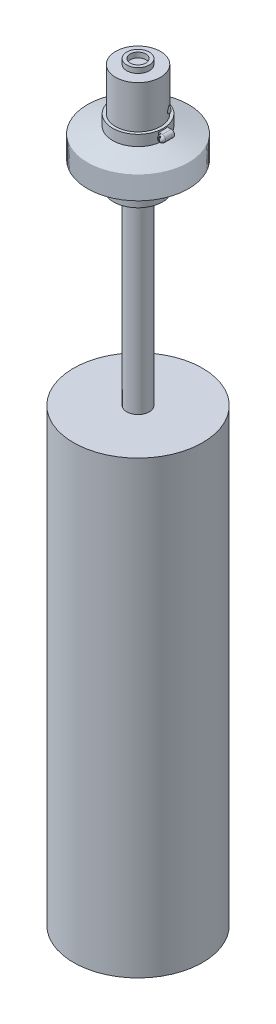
ISO-10303-21;
HEADER;
FILE_DESCRIPTION(('STEP AP214'),'2;1');
FILE_NAME('part.step','',(''),(''),'','','');
FILE_SCHEMA(('AUTOMOTIVE_DESIGN { 1 0 10303 214 1 1 1 1 }'));
ENDSEC;
DATA;
#1=APPLICATION_CONTEXT('core data for automotive mechanical design processes');
#2=APPLICATION_PROTOCOL_DEFINITION('international standard','automotive_design',2000,#1);
#3=PRODUCT_CONTEXT('',#1,'mechanical');
#4=PRODUCT('Part','Part','',(#3));
#5=PRODUCT_RELATED_PRODUCT_CATEGORY('part','',(#4));
#6=PRODUCT_DEFINITION_FORMATION('','',#4);
#7=PRODUCT_DEFINITION_CONTEXT('part definition',#1,'design');
#8=PRODUCT_DEFINITION('design','',#6,#7);
#9=PRODUCT_DEFINITION_SHAPE('','',#8);
#10=(LENGTH_UNIT() NAMED_UNIT(*) SI_UNIT(.MILLI.,.METRE.));
#11=(NAMED_UNIT(*) PLANE_ANGLE_UNIT() SI_UNIT($,.RADIAN.));
#12=(NAMED_UNIT(*) SI_UNIT($,.STERADIAN.) SOLID_ANGLE_UNIT());
#13=UNCERTAINTY_MEASURE_WITH_UNIT(LENGTH_MEASURE(1.E-05),#10,'distance_accuracy_value','');
#14=(GEOMETRIC_REPRESENTATION_CONTEXT(3) GLOBAL_UNCERTAINTY_ASSIGNED_CONTEXT((#13)) GLOBAL_UNIT_ASSIGNED_CONTEXT((#10,
#11,#12)) REPRESENTATION_CONTEXT('',''));
#15=CARTESIAN_POINT('',(0.,0.,0.));
#16=DIRECTION('',(0.,0.,1.));
#17=DIRECTION('',(1.,0.,0.));
#18=AXIS2_PLACEMENT_3D('',#15,#16,#17);
#19=CARTESIAN_POINT('',(0.,605.6,0.));
#20=DIRECTION('',(0.,1.,0.));
#21=DIRECTION('',(0.,0.,1.));
#22=AXIS2_PLACEMENT_3D('',#19,#20,#21);
#23=PLANE('',#22);
#24=CARTESIAN_POINT('',(0.,605.6,0.));
#25=DIRECTION('',(0.,1.,0.));
#26=DIRECTION('',(0.,0.,1.));
#27=AXIS2_PLACEMENT_3D('',#24,#25,#26);
#28=CIRCLE('',#27,22.6);
#29=CARTESIAN_POINT('',(0.,605.6,22.6));
#30=VERTEX_POINT('',#29);
#31=EDGE_CURVE('E246',#30,#30,#28,.T.);
#32=ORIENTED_EDGE('',*,*,#31,.T.);
#33=EDGE_LOOP('',(#32));
#34=FACE_BOUND('',#33,.T.);
#35=CARTESIAN_POINT('',(0.,605.6,0.));
#36=DIRECTION('',(0.,1.,0.));
#37=DIRECTION('',(0.,0.,1.));
#38=AXIS2_PLACEMENT_3D('',#35,#36,#37);
#39=CIRCLE('',#38,20.);
#40=CARTESIAN_POINT('',(0.,605.6,20.));
#41=VERTEX_POINT('',#40);
#42=EDGE_CURVE('E1530',#41,#41,#39,.T.);
#43=ORIENTED_EDGE('',*,*,#42,.F.);
#44=EDGE_LOOP('',(#43));
#45=FACE_BOUND('',#44,.T.);
#46=ADVANCED_FACE('F34',(#34,#45),#23,.T.);
#47=CARTESIAN_POINT('',(0.,380.5,0.));
#48=DIRECTION('',(0.,-1.,0.));
#49=DIRECTION('',(0.,0.,-1.));
#50=AXIS2_PLACEMENT_3D('',#47,#48,#49);
#51=PLANE('',#50);
#52=CARTESIAN_POINT('',(0.,380.5,0.));
#53=DIRECTION('',(0.,-1.,0.));
#54=DIRECTION('',(0.,0.,-1.));
#55=AXIS2_PLACEMENT_3D('',#52,#53,#54);
#56=CIRCLE('',#55,57.4718588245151);
#57=CARTESIAN_POINT('',(0.,380.5,-57.4718588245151));
#58=VERTEX_POINT('',#57);
#59=EDGE_CURVE('E791',#58,#58,#56,.T.);
#60=ORIENTED_EDGE('',*,*,#59,.F.);
#61=EDGE_LOOP('',(#60));
#62=FACE_BOUND('',#61,.T.);
#63=CARTESIAN_POINT('',(0.,380.5,0.));
#64=DIRECTION('',(0.,-1.,0.));
#65=DIRECTION('',(0.,0.,-1.));
#66=AXIS2_PLACEMENT_3D('',#63,#64,#65);
#67=CIRCLE('',#66,10.);
#68=CARTESIAN_POINT('',(0.,380.5,-10.));
#69=VERTEX_POINT('',#68);
#70=EDGE_CURVE('E795',#69,#69,#67,.F.);
#71=ORIENTED_EDGE('',*,*,#70,.F.);
#72=EDGE_LOOP('',(#71));
#73=FACE_BOUND('',#72,.T.);
#74=ADVANCED_FACE('F205',(#62,#73),#51,.F.);
#75=CARTESIAN_POINT('',(0.,380.5,0.));
#76=DIRECTION('',(0.,-1.,0.));
#77=DIRECTION('',(0.,0.,-1.));
#78=AXIS2_PLACEMENT_3D('',#75,#76,#77);
#79=CYLINDRICAL_SURFACE('',#78,57.4718588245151);
#80=ORIENTED_EDGE('',*,*,#59,.T.);
#81=EDGE_LOOP('',(#80));
#82=FACE_BOUND('',#81,.T.);
#83=CARTESIAN_POINT('',(0.,-20.5,0.));
#84=DIRECTION('',(0.,-1.,0.));
#85=DIRECTION('',(0.,0.,-1.));
#86=AXIS2_PLACEMENT_3D('',#83,#84,#85);
#87=CIRCLE('',#86,57.4718588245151);
#88=CARTESIAN_POINT('',(0.,-20.5,-57.4718588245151));
#89=VERTEX_POINT('',#88);
#90=EDGE_CURVE('E789',#89,#89,#87,.T.);
#91=ORIENTED_EDGE('',*,*,#90,.F.);
#92=EDGE_LOOP('',(#91));
#93=FACE_BOUND('',#92,.T.);
#94=ADVANCED_FACE('F36',(#82,#93),#79,.T.);
#95=CARTESIAN_POINT('',(0.,-20.5,0.));
#96=DIRECTION('',(0.,-1.,0.));
#97=DIRECTION('',(0.,0.,-1.));
#98=AXIS2_PLACEMENT_3D('',#95,#96,#97);
#99=PLANE('',#98);
#100=ORIENTED_EDGE('',*,*,#90,.T.);
#101=EDGE_LOOP('',(#100));
#102=FACE_BOUND('',#101,.T.);
#103=ADVANCED_FACE('F774',(#102),#99,.T.);
#104=CARTESIAN_POINT('',(0.,548.5,0.));
#105=DIRECTION('',(0.,1.,0.));
#106=DIRECTION('',(0.,0.,1.));
#107=AXIS2_PLACEMENT_3D('',#104,#105,#106);
#108=CYLINDRICAL_SURFACE('',#107,22.);
#109=CARTESIAN_POINT('',(0.,548.5,0.));
#110=DIRECTION('',(0.,-1.,0.));
#111=DIRECTION('',(0.,0.,-1.));
#112=AXIS2_PLACEMENT_3D('',#109,#110,#111);
#113=CIRCLE('',#112,22.);
#114=CARTESIAN_POINT('',(0.,548.5,-22.));
#115=VERTEX_POINT('',#114);
#116=EDGE_CURVE('E157',#115,#115,#113,.T.);
#117=ORIENTED_EDGE('',*,*,#116,.F.);
#118=EDGE_LOOP('',(#117));
#119=FACE_BOUND('',#118,.T.);
#120=CARTESIAN_POINT('',(0.,555.42,0.));
#121=DIRECTION('',(0.,1.,0.));
#122=DIRECTION('',(0.,0.,1.));
#123=AXIS2_PLACEMENT_3D('',#120,#121,#122);
#124=CIRCLE('',#123,22.);
#125=CARTESIAN_POINT('',(0.,555.42,22.));
#126=VERTEX_POINT('',#125);
#127=EDGE_CURVE('E798',#126,#126,#124,.F.);
#128=ORIENTED_EDGE('',*,*,#127,.T.);
#129=EDGE_LOOP('',(#128));
#130=FACE_BOUND('',#129,.T.);
#131=ADVANCED_FACE('F776',(#119,#130),#108,.T.);
#132=CARTESIAN_POINT('',(0.,548.5,0.));
#133=DIRECTION('',(0.,-1.,0.));
#134=DIRECTION('',(0.,0.,-1.));
#135=AXIS2_PLACEMENT_3D('',#132,#133,#134);
#136=PLANE('',#135);
#137=ORIENTED_EDGE('',*,*,#116,.T.);
#138=EDGE_LOOP('',(#137));
#139=FACE_BOUND('',#138,.T.);
#140=CARTESIAN_POINT('',(0.,548.5,0.));
#141=DIRECTION('',(0.,-1.,0.));
#142=DIRECTION('',(0.,0.,-1.));
#143=AXIS2_PLACEMENT_3D('',#140,#141,#142);
#144=CIRCLE('',#143,10.);
#145=CARTESIAN_POINT('',(0.,548.5,-10.));
#146=VERTEX_POINT('',#145);
#147=EDGE_CURVE('E1518',#146,#146,#144,.T.);
#148=ORIENTED_EDGE('',*,*,#147,.F.);
#149=EDGE_LOOP('',(#148));
#150=FACE_BOUND('',#149,.T.);
#151=ADVANCED_FACE('F783',(#139,#150),#136,.T.);
#152=CARTESIAN_POINT('',(26.1,597.350000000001,5.75));
#153=DIRECTION('',(0.,0.,-1.));
#154=DIRECTION('',(-1.,0.,0.));
#155=AXIS2_PLACEMENT_3D('',#152,#153,#154);
#156=PLANE('',#155);
#157=DIRECTION('',(0.,1.,0.));
#158=VECTOR('',#157,1.);
#159=CARTESIAN_POINT('',(25.1,597.350000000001,5.75));
#160=LINE('',#159,#158);
#161=CARTESIAN_POINT('',(25.1,598.965151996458,5.75));
#162=VERTEX_POINT('',#161);
#163=CARTESIAN_POINT('',(25.1,603.734848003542,5.75));
#164=VERTEX_POINT('',#163);
#165=EDGE_CURVE('E1534',#162,#164,#160,.T.);
#166=ORIENTED_EDGE('',*,*,#165,.F.);
#167=CARTESIAN_POINT('',(25.6,601.35,5.75));
#168=DIRECTION('',(0.,0.,-1.));
#169=DIRECTION('',(-1.,0.,0.));
#170=AXIS2_PLACEMENT_3D('',#167,#168,#169);
#171=CIRCLE('',#170,2.43669858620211);
#172=CARTESIAN_POINT('',(26.1,598.965151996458,5.75));
#173=VERTEX_POINT('',#172);
#174=EDGE_CURVE('E1582',#173,#162,#171,.T.);
#175=ORIENTED_EDGE('',*,*,#174,.F.);
#176=DIRECTION('',(0.,1.,0.));
#177=VECTOR('',#176,1.);
#178=CARTESIAN_POINT('',(26.1,597.350000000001,5.75));
#179=LINE('',#178,#177);
#180=CARTESIAN_POINT('',(26.1,603.734848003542,5.75));
#181=VERTEX_POINT('',#180);
#182=EDGE_CURVE('E1533',#173,#181,#179,.T.);
#183=ORIENTED_EDGE('',*,*,#182,.T.);
#184=EDGE_CURVE('E1588',#164,#181,#171,.T.);
#185=ORIENTED_EDGE('',*,*,#184,.F.);
#186=EDGE_LOOP('',(#166,#175,#183,#185));
#187=FACE_BOUND('',#186,.T.);
#188=ADVANCED_FACE('F1461',(#187),#156,.F.);
#189=CARTESIAN_POINT('',(25.1,597.350000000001,5.75));
#190=DIRECTION('',(-1.,0.,0.));
#191=DIRECTION('',(0.,0.,1.));
#192=AXIS2_PLACEMENT_3D('',#189,#190,#191);
#193=PLANE('',#192);
#194=ORIENTED_EDGE('',*,*,#165,.T.);
#195=CARTESIAN_POINT('',(25.1,601.35,4.));
#196=DIRECTION('',(-1.,0.,0.));
#197=DIRECTION('',(0.,0.,1.));
#198=AXIS2_PLACEMENT_3D('',#195,#196,#197);
#199=CIRCLE('',#198,2.9580398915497);
#200=EDGE_CURVE('E1587',#162,#164,#199,.T.);
#201=ORIENTED_EDGE('',*,*,#200,.F.);
#202=EDGE_LOOP('',(#194,#201));
#203=FACE_BOUND('',#202,.T.);
#204=ADVANCED_FACE('F1451',(#203),#193,.F.);
#205=CARTESIAN_POINT('',(26.1,597.350000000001,5.75));
#206=DIRECTION('',(1.,0.,0.));
#207=DIRECTION('',(0.,0.,-1.));
#208=AXIS2_PLACEMENT_3D('',#205,#206,#207);
#209=PLANE('',#208);
#210=ORIENTED_EDGE('',*,*,#182,.F.);
#211=CARTESIAN_POINT('',(26.1,601.35,4.));
#212=DIRECTION('',(1.,0.,0.));
#213=DIRECTION('',(0.,0.,-1.));
#214=AXIS2_PLACEMENT_3D('',#211,#212,#213);
#215=CIRCLE('',#214,2.9580398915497);
#216=EDGE_CURVE('E1591',#181,#173,#215,.T.);
#217=ORIENTED_EDGE('',*,*,#216,.F.);
#218=EDGE_LOOP('',(#210,#217));
#219=FACE_BOUND('',#218,.T.);
#220=ADVANCED_FACE('F1441',(#219),#209,.F.);
#221=CARTESIAN_POINT('',(25.6,601.35,4.));
#222=DIRECTION('',(0.,1.,0.));
#223=DIRECTION('',(-1.,0.,0.));
#224=AXIS2_PLACEMENT_3D('',#221,#222,#223);
#225=SPHERICAL_SURFACE('',#224,2.99999999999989);
#226=ORIENTED_EDGE('',*,*,#200,.T.);
#227=ORIENTED_EDGE('',*,*,#184,.T.);
#228=ORIENTED_EDGE('',*,*,#216,.T.);
#229=ORIENTED_EDGE('',*,*,#174,.T.);
#230=EDGE_LOOP('',(#226,#227,#228,#229));
#231=FACE_BOUND('',#230,.T.);
#232=CARTESIAN_POINT('',(25.6,601.35,4.));
#233=DIRECTION('',(0.,0.,1.));
#234=DIRECTION('',(1.,0.,0.));
#235=AXIS2_PLACEMENT_3D('',#232,#233,#234);
#236=CIRCLE('',#235,2.99999999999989);
#237=CARTESIAN_POINT('',(25.6,598.35,4.));
#238=VERTEX_POINT('',#237);
#239=CARTESIAN_POINT('',(25.6,604.35,4.));
#240=VERTEX_POINT('',#239);
#241=EDGE_CURVE('E1537',#238,#240,#236,.F.);
#242=ORIENTED_EDGE('',*,*,#241,.F.);
#243=CARTESIAN_POINT('',(25.6,601.35,4.));
#244=DIRECTION('',(0.,0.,1.));
#245=DIRECTION('',(1.,0.,0.));
#246=AXIS2_PLACEMENT_3D('',#243,#244,#245);
#247=CIRCLE('',#246,3.);
#248=EDGE_CURVE('E1545',#238,#240,#247,.T.);
#249=ORIENTED_EDGE('',*,*,#248,.T.);
#250=EDGE_LOOP('',(#242,#249));
#251=FACE_BOUND('',#250,.T.);
#252=ADVANCED_FACE('F1432',(#231,#251),#225,.T.);
#253=CARTESIAN_POINT('',(25.6,601.35,4.));
#254=DIRECTION('',(0.,0.,-1.));
#255=DIRECTION('',(-1.,0.,0.));
#256=AXIS2_PLACEMENT_3D('',#253,#254,#255);
#257=CYLINDRICAL_SURFACE('',#256,3.);
#258=CARTESIAN_POINT('',(25.6,601.35,-4.));
#259=DIRECTION('',(0.,0.,1.));
#260=DIRECTION('',(1.,0.,0.));
#261=AXIS2_PLACEMENT_3D('',#258,#259,#260);
#262=CIRCLE('',#261,3.);
#263=CARTESIAN_POINT('',(25.6,598.35,-4.));
#264=VERTEX_POINT('',#263);
#265=CARTESIAN_POINT('',(25.6,604.35,-4.));
#266=VERTEX_POINT('',#265);
#267=EDGE_CURVE('E1554',#264,#266,#262,.T.);
#268=ORIENTED_EDGE('',*,*,#267,.T.);
#269=DIRECTION('',(0.,0.,-1.));
#270=VECTOR('',#269,1.);
#271=CARTESIAN_POINT('',(25.6,604.35,4.));
#272=LINE('',#271,#270);
#273=EDGE_CURVE('E1552',#240,#266,#272,.T.);
#274=ORIENTED_EDGE('',*,*,#273,.F.);
#275=ORIENTED_EDGE('',*,*,#248,.F.);
#276=DIRECTION('',(0.,0.,-1.));
#277=VECTOR('',#276,1.);
#278=CARTESIAN_POINT('',(25.6,598.35,4.));
#279=LINE('',#278,#277);
#280=EDGE_CURVE('E1560',#238,#264,#279,.T.);
#281=ORIENTED_EDGE('',*,*,#280,.T.);
#282=EDGE_LOOP('',(#268,#274,#275,#281));
#283=FACE_BOUND('',#282,.T.);
#284=ADVANCED_FACE('F1422',(#283),#257,.T.);
#285=CARTESIAN_POINT('',(25.6,601.35,-4.));
#286=DIRECTION('',(0.,0.,1.));
#287=DIRECTION('',(1.,0.,0.));
#288=AXIS2_PLACEMENT_3D('',#285,#286,#287);
#289=PLANE('',#288);
#290=DIRECTION('',(1.,0.,0.));
#291=VECTOR('',#290,1.);
#292=CARTESIAN_POINT('',(21.6,598.35,-4.));
#293=LINE('',#292,#291);
#294=CARTESIAN_POINT('',(22.2432012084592,598.35,-4.));
#295=VERTEX_POINT('',#294);
#296=EDGE_CURVE('E1542',#295,#264,#293,.T.);
#297=ORIENTED_EDGE('',*,*,#296,.F.);
#298=DIRECTION('',(0.,-1.,0.));
#299=VECTOR('',#298,1.);
#300=CARTESIAN_POINT('',(22.2432012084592,605.6,-4.));
#301=LINE('',#300,#299);
#302=CARTESIAN_POINT('',(22.2432012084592,604.35,-4.));
#303=VERTEX_POINT('',#302);
#304=EDGE_CURVE('E476',#295,#303,#301,.F.);
#305=ORIENTED_EDGE('',*,*,#304,.T.);
#306=DIRECTION('',(-1.,0.,0.));
#307=VECTOR('',#306,1.);
#308=CARTESIAN_POINT('',(21.6,604.35,-4.));
#309=LINE('',#308,#307);
#310=EDGE_CURVE('E1546',#266,#303,#309,.T.);
#311=ORIENTED_EDGE('',*,*,#310,.F.);
#312=ORIENTED_EDGE('',*,*,#267,.F.);
#313=EDGE_LOOP('',(#297,#305,#311,#312));
#314=FACE_BOUND('',#313,.T.);
#315=ADVANCED_FACE('F1412',(#314),#289,.F.);
#316=CARTESIAN_POINT('',(21.6,604.35,4.));
#317=DIRECTION('',(0.,-1.,0.));
#318=DIRECTION('',(1.,0.,0.));
#319=AXIS2_PLACEMENT_3D('',#316,#317,#318);
#320=PLANE('',#319);
#321=ORIENTED_EDGE('',*,*,#310,.T.);
#322=CARTESIAN_POINT('',(0.,604.350000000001,0.));
#323=DIRECTION('',(0.,-1.,0.));
#324=DIRECTION('',(1.,0.,0.));
#325=AXIS2_PLACEMENT_3D('',#322,#323,#324);
#326=CIRCLE('',#325,22.6);
#327=CARTESIAN_POINT('',(22.2432012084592,604.35,4.));
#328=VERTEX_POINT('',#327);
#329=EDGE_CURVE('E1575',#303,#328,#326,.T.);
#330=ORIENTED_EDGE('',*,*,#329,.T.);
#331=DIRECTION('',(-1.,0.,0.));
#332=VECTOR('',#331,1.);
#333=CARTESIAN_POINT('',(21.6,604.35,4.));
#334=LINE('',#333,#332);
#335=EDGE_CURVE('E1549',#240,#328,#334,.T.);
#336=ORIENTED_EDGE('',*,*,#335,.F.);
#337=ORIENTED_EDGE('',*,*,#273,.T.);
#338=EDGE_LOOP('',(#321,#330,#336,#337));
#339=FACE_BOUND('',#338,.T.);
#340=ADVANCED_FACE('F1403',(#339),#320,.F.);
#341=CARTESIAN_POINT('',(21.6,598.35,4.));
#342=DIRECTION('',(0.,1.,0.));
#343=DIRECTION('',(-1.,0.,0.));
#344=AXIS2_PLACEMENT_3D('',#341,#342,#343);
#345=PLANE('',#344);
#346=DIRECTION('',(1.,0.,0.));
#347=VECTOR('',#346,1.);
#348=CARTESIAN_POINT('',(21.6,598.35,4.));
#349=LINE('',#348,#347);
#350=CARTESIAN_POINT('',(22.2432012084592,598.35,4.));
#351=VERTEX_POINT('',#350);
#352=EDGE_CURVE('E1543',#351,#238,#349,.T.);
#353=ORIENTED_EDGE('',*,*,#352,.F.);
#354=CARTESIAN_POINT('',(0.,598.350000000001,0.));
#355=DIRECTION('',(0.,1.,0.));
#356=DIRECTION('',(-1.,0.,0.));
#357=AXIS2_PLACEMENT_3D('',#354,#355,#356);
#358=CIRCLE('',#357,22.6);
#359=EDGE_CURVE('E1580',#351,#295,#358,.T.);
#360=ORIENTED_EDGE('',*,*,#359,.T.);
#361=ORIENTED_EDGE('',*,*,#296,.T.);
#362=ORIENTED_EDGE('',*,*,#280,.F.);
#363=EDGE_LOOP('',(#353,#360,#361,#362));
#364=FACE_BOUND('',#363,.T.);
#365=ADVANCED_FACE('F220',(#364),#345,.F.);
#366=CARTESIAN_POINT('',(0.,605.6,0.));
#367=DIRECTION('',(0.,-1.,0.));
#368=DIRECTION('',(0.,0.,-1.));
#369=AXIS2_PLACEMENT_3D('',#366,#367,#368);
#370=CYLINDRICAL_SURFACE('',#369,22.6);
#371=ORIENTED_EDGE('',*,*,#359,.F.);
#372=DIRECTION('',(0.,-1.,0.));
#373=VECTOR('',#372,1.);
#374=CARTESIAN_POINT('',(22.2432012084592,605.6,4.));
#375=LINE('',#374,#373);
#376=EDGE_CURVE('E1578',#351,#328,#375,.F.);
#377=ORIENTED_EDGE('',*,*,#376,.T.);
#378=ORIENTED_EDGE('',*,*,#329,.F.);
#379=ORIENTED_EDGE('',*,*,#304,.F.);
#380=EDGE_LOOP('',(#371,#377,#378,#379));
#381=FACE_BOUND('',#380,.T.);
#382=ORIENTED_EDGE('',*,*,#31,.F.);
#383=EDGE_LOOP('',(#382));
#384=FACE_BOUND('',#383,.T.);
#385=CARTESIAN_POINT('',(0.,596.1,0.));
#386=DIRECTION('',(0.,1.,0.));
#387=DIRECTION('',(0.,0.,1.));
#388=AXIS2_PLACEMENT_3D('',#385,#386,#387);
#389=CIRCLE('',#388,22.6);
#390=CARTESIAN_POINT('',(0.,596.1,22.6));
#391=VERTEX_POINT('',#390);
#392=EDGE_CURVE('E480',#391,#391,#389,.T.);
#393=ORIENTED_EDGE('',*,*,#392,.T.);
#394=EDGE_LOOP('',(#393));
#395=FACE_BOUND('',#394,.T.);
#396=ADVANCED_FACE('F222',(#381,#384,#395),#370,.T.);
#397=CARTESIAN_POINT('',(0.,596.1,0.));
#398=DIRECTION('',(0.,-1.,0.));
#399=DIRECTION('',(0.,0.,-1.));
#400=AXIS2_PLACEMENT_3D('',#397,#398,#399);
#401=CONICAL_SURFACE('',#400,22.6076951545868,1.30899693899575);
#402=CARTESIAN_POINT('',(0.,590.1,0.));
#403=DIRECTION('',(0.,-1.,0.));
#404=DIRECTION('',(0.,0.,-1.));
#405=AXIS2_PLACEMENT_3D('',#402,#403,#404);
#406=CIRCLE('',#405,45.);
#407=CARTESIAN_POINT('',(0.,590.1,-45.));
#408=VERTEX_POINT('',#407);
#409=EDGE_CURVE('E237',#408,#408,#406,.T.);
#410=ORIENTED_EDGE('',*,*,#409,.F.);
#411=EDGE_LOOP('',(#410));
#412=FACE_BOUND('',#411,.T.);
#413=ORIENTED_EDGE('',*,*,#392,.F.);
#414=EDGE_LOOP('',(#413));
#415=FACE_BOUND('',#414,.T.);
#416=ADVANCED_FACE('F226',(#412,#415),#401,.T.);
#417=CARTESIAN_POINT('',(0.,590.1,0.));
#418=DIRECTION('',(0.,1.,0.));
#419=DIRECTION('',(0.,0.,1.));
#420=AXIS2_PLACEMENT_3D('',#417,#418,#419);
#421=CONICAL_SURFACE('',#420,45.,1.30899693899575);
#422=ORIENTED_EDGE('',*,*,#409,.T.);
#423=EDGE_LOOP('',(#422));
#424=FACE_BOUND('',#423,.T.);
#425=CARTESIAN_POINT('',(0.,589.73,0.));
#426=DIRECTION('',(0.,1.,0.));
#427=DIRECTION('',(0.,0.,1.));
#428=AXIS2_PLACEMENT_3D('',#425,#426,#427);
#429=CIRCLE('',#428,43.6191412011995);
#430=CARTESIAN_POINT('',(0.,589.73,43.6191412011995));
#431=VERTEX_POINT('',#430);
#432=EDGE_CURVE('E473',#431,#431,#429,.T.);
#433=ORIENTED_EDGE('',*,*,#432,.T.);
#434=EDGE_LOOP('',(#433));
#435=FACE_BOUND('',#434,.T.);
#436=ADVANCED_FACE('F228',(#424,#435),#421,.T.);
#437=CARTESIAN_POINT('',(0.,589.36,0.));
#438=DIRECTION('',(0.,1.,0.));
#439=DIRECTION('',(0.,0.,1.));
#440=AXIS2_PLACEMENT_3D('',#437,#438,#439);
#441=CONICAL_SURFACE('',#440,45.,1.30899693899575);
#442=CARTESIAN_POINT('',(0.,589.36,0.));
#443=DIRECTION('',(0.,-1.,0.));
#444=DIRECTION('',(0.,0.,-1.));
#445=AXIS2_PLACEMENT_3D('',#442,#443,#444);
#446=CIRCLE('',#445,45.);
#447=CARTESIAN_POINT('',(0.,589.36,-45.));
#448=VERTEX_POINT('',#447);
#449=EDGE_CURVE('E245',#448,#448,#446,.T.);
#450=ORIENTED_EDGE('',*,*,#449,.T.);
#451=EDGE_LOOP('',(#450));
#452=FACE_BOUND('',#451,.T.);
#453=CARTESIAN_POINT('',(0.,588.99,0.));
#454=DIRECTION('',(0.,1.,0.));
#455=DIRECTION('',(0.,0.,1.));
#456=AXIS2_PLACEMENT_3D('',#453,#454,#455);
#457=CIRCLE('',#456,43.6191412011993);
#458=CARTESIAN_POINT('',(0.,588.99,43.6191412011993));
#459=VERTEX_POINT('',#458);
#460=EDGE_CURVE('E470',#459,#459,#457,.T.);
#461=ORIENTED_EDGE('',*,*,#460,.T.);
#462=EDGE_LOOP('',(#461));
#463=FACE_BOUND('',#462,.T.);
#464=ADVANCED_FACE('F494',(#452,#463),#441,.T.);
#465=CARTESIAN_POINT('',(0.,588.62,0.));
#466=DIRECTION('',(0.,1.,0.));
#467=DIRECTION('',(0.,0.,1.));
#468=AXIS2_PLACEMENT_3D('',#465,#466,#467);
#469=CONICAL_SURFACE('',#468,45.,1.30899693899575);
#470=CARTESIAN_POINT('',(0.,588.62,0.));
#471=DIRECTION('',(0.,-1.,0.));
#472=DIRECTION('',(0.,0.,-1.));
#473=AXIS2_PLACEMENT_3D('',#470,#471,#472);
#474=CIRCLE('',#473,45.);
#475=CARTESIAN_POINT('',(0.,588.62,-45.));
#476=VERTEX_POINT('',#475);
#477=EDGE_CURVE('E249',#476,#476,#474,.T.);
#478=ORIENTED_EDGE('',*,*,#477,.T.);
#479=EDGE_LOOP('',(#478));
#480=FACE_BOUND('',#479,.T.);
#481=CARTESIAN_POINT('',(0.,588.25,0.));
#482=DIRECTION('',(0.,1.,0.));
#483=DIRECTION('',(0.,0.,1.));
#484=AXIS2_PLACEMENT_3D('',#481,#482,#483);
#485=CIRCLE('',#484,43.6191412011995);
#486=CARTESIAN_POINT('',(0.,588.25,43.6191412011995));
#487=VERTEX_POINT('',#486);
#488=EDGE_CURVE('E467',#487,#487,#485,.T.);
#489=ORIENTED_EDGE('',*,*,#488,.T.);
#490=EDGE_LOOP('',(#489));
#491=FACE_BOUND('',#490,.T.);
#492=ADVANCED_FACE('F497',(#480,#491),#469,.T.);
#493=CARTESIAN_POINT('',(0.,587.88,0.));
#494=DIRECTION('',(0.,1.,0.));
#495=DIRECTION('',(0.,0.,1.));
#496=AXIS2_PLACEMENT_3D('',#493,#494,#495);
#497=CONICAL_SURFACE('',#496,45.,1.30899693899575);
#498=CARTESIAN_POINT('',(0.,587.88,0.));
#499=DIRECTION('',(0.,-1.,0.));
#500=DIRECTION('',(0.,0.,-1.));
#501=AXIS2_PLACEMENT_3D('',#498,#499,#500);
#502=CIRCLE('',#501,45.);
#503=CARTESIAN_POINT('',(0.,587.88,-45.));
#504=VERTEX_POINT('',#503);
#505=EDGE_CURVE('E252',#504,#504,#502,.T.);
#506=ORIENTED_EDGE('',*,*,#505,.T.);
#507=EDGE_LOOP('',(#506));
#508=FACE_BOUND('',#507,.T.);
#509=CARTESIAN_POINT('',(0.,587.51,0.));
#510=DIRECTION('',(0.,1.,0.));
#511=DIRECTION('',(0.,0.,1.));
#512=AXIS2_PLACEMENT_3D('',#509,#510,#511);
#513=CIRCLE('',#512,43.6191412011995);
#514=CARTESIAN_POINT('',(0.,587.51,43.6191412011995));
#515=VERTEX_POINT('',#514);
#516=EDGE_CURVE('E464',#515,#515,#513,.T.);
#517=ORIENTED_EDGE('',*,*,#516,.T.);
#518=EDGE_LOOP('',(#517));
#519=FACE_BOUND('',#518,.T.);
#520=ADVANCED_FACE('F507',(#508,#519),#497,.T.);
#521=CARTESIAN_POINT('',(0.,587.14,0.));
#522=DIRECTION('',(0.,1.,0.));
#523=DIRECTION('',(0.,0.,1.));
#524=AXIS2_PLACEMENT_3D('',#521,#522,#523);
#525=CONICAL_SURFACE('',#524,45.,1.30899693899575);
#526=CARTESIAN_POINT('',(0.,587.14,0.));
#527=DIRECTION('',(0.,-1.,0.));
#528=DIRECTION('',(0.,0.,-1.));
#529=AXIS2_PLACEMENT_3D('',#526,#527,#528);
#530=CIRCLE('',#529,45.);
#531=CARTESIAN_POINT('',(0.,587.14,-45.));
#532=VERTEX_POINT('',#531);
#533=EDGE_CURVE('E255',#532,#532,#530,.T.);
#534=ORIENTED_EDGE('',*,*,#533,.T.);
#535=EDGE_LOOP('',(#534));
#536=FACE_BOUND('',#535,.T.);
#537=CARTESIAN_POINT('',(0.,586.77,0.));
#538=DIRECTION('',(0.,1.,0.));
#539=DIRECTION('',(0.,0.,1.));
#540=AXIS2_PLACEMENT_3D('',#537,#538,#539);
#541=CIRCLE('',#540,43.6191412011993);
#542=CARTESIAN_POINT('',(0.,586.77,43.6191412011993));
#543=VERTEX_POINT('',#542);
#544=EDGE_CURVE('E461',#543,#543,#541,.T.);
#545=ORIENTED_EDGE('',*,*,#544,.T.);
#546=EDGE_LOOP('',(#545));
#547=FACE_BOUND('',#546,.T.);
#548=ADVANCED_FACE('F515',(#536,#547),#525,.T.);
#549=CARTESIAN_POINT('',(0.,586.4,0.));
#550=DIRECTION('',(0.,1.,0.));
#551=DIRECTION('',(0.,0.,1.));
#552=AXIS2_PLACEMENT_3D('',#549,#550,#551);
#553=CONICAL_SURFACE('',#552,45.,1.30899693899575);
#554=CARTESIAN_POINT('',(0.,586.4,0.));
#555=DIRECTION('',(0.,-1.,0.));
#556=DIRECTION('',(0.,0.,-1.));
#557=AXIS2_PLACEMENT_3D('',#554,#555,#556);
#558=CIRCLE('',#557,45.);
#559=CARTESIAN_POINT('',(0.,586.4,-45.));
#560=VERTEX_POINT('',#559);
#561=EDGE_CURVE('E258',#560,#560,#558,.T.);
#562=ORIENTED_EDGE('',*,*,#561,.T.);
#563=EDGE_LOOP('',(#562));
#564=FACE_BOUND('',#563,.T.);
#565=CARTESIAN_POINT('',(0.,586.03,0.));
#566=DIRECTION('',(0.,1.,0.));
#567=DIRECTION('',(0.,0.,1.));
#568=AXIS2_PLACEMENT_3D('',#565,#566,#567);
#569=CIRCLE('',#568,43.6191412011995);
#570=CARTESIAN_POINT('',(0.,586.03,43.6191412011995));
#571=VERTEX_POINT('',#570);
#572=EDGE_CURVE('E458',#571,#571,#569,.T.);
#573=ORIENTED_EDGE('',*,*,#572,.T.);
#574=EDGE_LOOP('',(#573));
#575=FACE_BOUND('',#574,.T.);
#576=ADVANCED_FACE('F523',(#564,#575),#553,.T.);
#577=CARTESIAN_POINT('',(0.,585.66,0.));
#578=DIRECTION('',(0.,1.,0.));
#579=DIRECTION('',(0.,0.,1.));
#580=AXIS2_PLACEMENT_3D('',#577,#578,#579);
#581=CONICAL_SURFACE('',#580,45.,1.30899693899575);
#582=CARTESIAN_POINT('',(0.,585.66,0.));
#583=DIRECTION('',(0.,-1.,0.));
#584=DIRECTION('',(0.,0.,-1.));
#585=AXIS2_PLACEMENT_3D('',#582,#583,#584);
#586=CIRCLE('',#585,45.);
#587=CARTESIAN_POINT('',(0.,585.66,-45.));
#588=VERTEX_POINT('',#587);
#589=EDGE_CURVE('E261',#588,#588,#586,.T.);
#590=ORIENTED_EDGE('',*,*,#589,.T.);
#591=EDGE_LOOP('',(#590));
#592=FACE_BOUND('',#591,.T.);
#593=CARTESIAN_POINT('',(0.,585.29,0.));
#594=DIRECTION('',(0.,1.,0.));
#595=DIRECTION('',(0.,0.,1.));
#596=AXIS2_PLACEMENT_3D('',#593,#594,#595);
#597=CIRCLE('',#596,43.6191412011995);
#598=CARTESIAN_POINT('',(0.,585.29,43.6191412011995));
#599=VERTEX_POINT('',#598);
#600=EDGE_CURVE('E455',#599,#599,#597,.T.);
#601=ORIENTED_EDGE('',*,*,#600,.T.);
#602=EDGE_LOOP('',(#601));
#603=FACE_BOUND('',#602,.T.);
#604=ADVANCED_FACE('F531',(#592,#603),#581,.T.);
#605=CARTESIAN_POINT('',(0.,584.92,0.));
#606=DIRECTION('',(0.,1.,0.));
#607=DIRECTION('',(0.,0.,1.));
#608=AXIS2_PLACEMENT_3D('',#605,#606,#607);
#609=CONICAL_SURFACE('',#608,45.,1.30899693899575);
#610=CARTESIAN_POINT('',(0.,584.92,0.));
#611=DIRECTION('',(0.,-1.,0.));
#612=DIRECTION('',(0.,0.,-1.));
#613=AXIS2_PLACEMENT_3D('',#610,#611,#612);
#614=CIRCLE('',#613,45.);
#615=CARTESIAN_POINT('',(0.,584.92,-45.));
#616=VERTEX_POINT('',#615);
#617=EDGE_CURVE('E264',#616,#616,#614,.T.);
#618=ORIENTED_EDGE('',*,*,#617,.T.);
#619=EDGE_LOOP('',(#618));
#620=FACE_BOUND('',#619,.T.);
#621=CARTESIAN_POINT('',(0.,584.55,0.));
#622=DIRECTION('',(0.,1.,0.));
#623=DIRECTION('',(0.,0.,1.));
#624=AXIS2_PLACEMENT_3D('',#621,#622,#623);
#625=CIRCLE('',#624,43.6191412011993);
#626=CARTESIAN_POINT('',(0.,584.55,43.6191412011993));
#627=VERTEX_POINT('',#626);
#628=EDGE_CURVE('E452',#627,#627,#625,.T.);
#629=ORIENTED_EDGE('',*,*,#628,.T.);
#630=EDGE_LOOP('',(#629));
#631=FACE_BOUND('',#630,.T.);
#632=ADVANCED_FACE('F539',(#620,#631),#609,.T.);
#633=CARTESIAN_POINT('',(0.,584.18,0.));
#634=DIRECTION('',(0.,1.,0.));
#635=DIRECTION('',(0.,0.,1.));
#636=AXIS2_PLACEMENT_3D('',#633,#634,#635);
#637=CONICAL_SURFACE('',#636,45.,1.30899693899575);
#638=CARTESIAN_POINT('',(0.,584.18,0.));
#639=DIRECTION('',(0.,-1.,0.));
#640=DIRECTION('',(0.,0.,-1.));
#641=AXIS2_PLACEMENT_3D('',#638,#639,#640);
#642=CIRCLE('',#641,45.);
#643=CARTESIAN_POINT('',(0.,584.18,-45.));
#644=VERTEX_POINT('',#643);
#645=EDGE_CURVE('E267',#644,#644,#642,.T.);
#646=ORIENTED_EDGE('',*,*,#645,.T.);
#647=EDGE_LOOP('',(#646));
#648=FACE_BOUND('',#647,.T.);
#649=CARTESIAN_POINT('',(0.,583.81,0.));
#650=DIRECTION('',(0.,1.,0.));
#651=DIRECTION('',(0.,0.,1.));
#652=AXIS2_PLACEMENT_3D('',#649,#650,#651);
#653=CIRCLE('',#652,43.6191412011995);
#654=CARTESIAN_POINT('',(0.,583.81,43.6191412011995));
#655=VERTEX_POINT('',#654);
#656=EDGE_CURVE('E449',#655,#655,#653,.T.);
#657=ORIENTED_EDGE('',*,*,#656,.T.);
#658=EDGE_LOOP('',(#657));
#659=FACE_BOUND('',#658,.T.);
#660=ADVANCED_FACE('F547',(#648,#659),#637,.T.);
#661=CARTESIAN_POINT('',(0.,583.44,0.));
#662=DIRECTION('',(0.,1.,0.));
#663=DIRECTION('',(0.,0.,1.));
#664=AXIS2_PLACEMENT_3D('',#661,#662,#663);
#665=CONICAL_SURFACE('',#664,45.,1.30899693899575);
#666=CARTESIAN_POINT('',(0.,583.44,0.));
#667=DIRECTION('',(0.,-1.,0.));
#668=DIRECTION('',(0.,0.,-1.));
#669=AXIS2_PLACEMENT_3D('',#666,#667,#668);
#670=CIRCLE('',#669,45.);
#671=CARTESIAN_POINT('',(0.,583.44,-45.));
#672=VERTEX_POINT('',#671);
#673=EDGE_CURVE('E270',#672,#672,#670,.T.);
#674=ORIENTED_EDGE('',*,*,#673,.T.);
#675=EDGE_LOOP('',(#674));
#676=FACE_BOUND('',#675,.T.);
#677=CARTESIAN_POINT('',(0.,583.07,0.));
#678=DIRECTION('',(0.,1.,0.));
#679=DIRECTION('',(0.,0.,1.));
#680=AXIS2_PLACEMENT_3D('',#677,#678,#679);
#681=CIRCLE('',#680,43.6191412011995);
#682=CARTESIAN_POINT('',(0.,583.07,43.6191412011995));
#683=VERTEX_POINT('',#682);
#684=EDGE_CURVE('E446',#683,#683,#681,.T.);
#685=ORIENTED_EDGE('',*,*,#684,.T.);
#686=EDGE_LOOP('',(#685));
#687=FACE_BOUND('',#686,.T.);
#688=ADVANCED_FACE('F555',(#676,#687),#665,.T.);
#689=CARTESIAN_POINT('',(0.,582.7,0.));
#690=DIRECTION('',(0.,1.,0.));
#691=DIRECTION('',(0.,0.,1.));
#692=AXIS2_PLACEMENT_3D('',#689,#690,#691);
#693=CONICAL_SURFACE('',#692,45.,1.30899693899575);
#694=CARTESIAN_POINT('',(0.,582.7,0.));
#695=DIRECTION('',(0.,-1.,0.));
#696=DIRECTION('',(0.,0.,-1.));
#697=AXIS2_PLACEMENT_3D('',#694,#695,#696);
#698=CIRCLE('',#697,45.);
#699=CARTESIAN_POINT('',(0.,582.7,-45.));
#700=VERTEX_POINT('',#699);
#701=EDGE_CURVE('E273',#700,#700,#698,.T.);
#702=ORIENTED_EDGE('',*,*,#701,.T.);
#703=EDGE_LOOP('',(#702));
#704=FACE_BOUND('',#703,.T.);
#705=CARTESIAN_POINT('',(0.,582.33,0.));
#706=DIRECTION('',(0.,1.,0.));
#707=DIRECTION('',(0.,0.,1.));
#708=AXIS2_PLACEMENT_3D('',#705,#706,#707);
#709=CIRCLE('',#708,43.6191412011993);
#710=CARTESIAN_POINT('',(0.,582.33,43.6191412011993));
#711=VERTEX_POINT('',#710);
#712=EDGE_CURVE('E443',#711,#711,#709,.T.);
#713=ORIENTED_EDGE('',*,*,#712,.T.);
#714=EDGE_LOOP('',(#713));
#715=FACE_BOUND('',#714,.T.);
#716=ADVANCED_FACE('F563',(#704,#715),#693,.T.);
#717=CARTESIAN_POINT('',(0.,581.96,0.));
#718=DIRECTION('',(0.,1.,0.));
#719=DIRECTION('',(0.,0.,1.));
#720=AXIS2_PLACEMENT_3D('',#717,#718,#719);
#721=CONICAL_SURFACE('',#720,45.,1.30899693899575);
#722=CARTESIAN_POINT('',(0.,581.96,0.));
#723=DIRECTION('',(0.,-1.,0.));
#724=DIRECTION('',(0.,0.,-1.));
#725=AXIS2_PLACEMENT_3D('',#722,#723,#724);
#726=CIRCLE('',#725,45.);
#727=CARTESIAN_POINT('',(0.,581.96,-45.));
#728=VERTEX_POINT('',#727);
#729=EDGE_CURVE('E276',#728,#728,#726,.T.);
#730=ORIENTED_EDGE('',*,*,#729,.T.);
#731=EDGE_LOOP('',(#730));
#732=FACE_BOUND('',#731,.T.);
#733=CARTESIAN_POINT('',(0.,581.59,0.));
#734=DIRECTION('',(0.,1.,0.));
#735=DIRECTION('',(0.,0.,1.));
#736=AXIS2_PLACEMENT_3D('',#733,#734,#735);
#737=CIRCLE('',#736,43.6191412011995);
#738=CARTESIAN_POINT('',(0.,581.59,43.6191412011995));
#739=VERTEX_POINT('',#738);
#740=EDGE_CURVE('E440',#739,#739,#737,.T.);
#741=ORIENTED_EDGE('',*,*,#740,.T.);
#742=EDGE_LOOP('',(#741));
#743=FACE_BOUND('',#742,.T.);
#744=ADVANCED_FACE('F571',(#732,#743),#721,.T.);
#745=CARTESIAN_POINT('',(0.,581.22,0.));
#746=DIRECTION('',(0.,1.,0.));
#747=DIRECTION('',(0.,0.,1.));
#748=AXIS2_PLACEMENT_3D('',#745,#746,#747);
#749=CONICAL_SURFACE('',#748,45.,1.30899693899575);
#750=CARTESIAN_POINT('',(0.,581.22,0.));
#751=DIRECTION('',(0.,-1.,0.));
#752=DIRECTION('',(0.,0.,-1.));
#753=AXIS2_PLACEMENT_3D('',#750,#751,#752);
#754=CIRCLE('',#753,45.);
#755=CARTESIAN_POINT('',(0.,581.22,-45.));
#756=VERTEX_POINT('',#755);
#757=EDGE_CURVE('E279',#756,#756,#754,.T.);
#758=ORIENTED_EDGE('',*,*,#757,.T.);
#759=EDGE_LOOP('',(#758));
#760=FACE_BOUND('',#759,.T.);
#761=CARTESIAN_POINT('',(0.,580.85,0.));
#762=DIRECTION('',(0.,1.,0.));
#763=DIRECTION('',(0.,0.,1.));
#764=AXIS2_PLACEMENT_3D('',#761,#762,#763);
#765=CIRCLE('',#764,43.6191412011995);
#766=CARTESIAN_POINT('',(0.,580.85,43.6191412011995));
#767=VERTEX_POINT('',#766);
#768=EDGE_CURVE('E437',#767,#767,#765,.T.);
#769=ORIENTED_EDGE('',*,*,#768,.T.);
#770=EDGE_LOOP('',(#769));
#771=FACE_BOUND('',#770,.T.);
#772=ADVANCED_FACE('F579',(#760,#771),#749,.T.);
#773=CARTESIAN_POINT('',(0.,580.48,0.));
#774=DIRECTION('',(0.,1.,0.));
#775=DIRECTION('',(0.,0.,1.));
#776=AXIS2_PLACEMENT_3D('',#773,#774,#775);
#777=CONICAL_SURFACE('',#776,45.,1.30899693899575);
#778=CARTESIAN_POINT('',(0.,580.48,0.));
#779=DIRECTION('',(0.,-1.,0.));
#780=DIRECTION('',(0.,0.,-1.));
#781=AXIS2_PLACEMENT_3D('',#778,#779,#780);
#782=CIRCLE('',#781,45.);
#783=CARTESIAN_POINT('',(0.,580.48,-45.));
#784=VERTEX_POINT('',#783);
#785=EDGE_CURVE('E282',#784,#784,#782,.T.);
#786=ORIENTED_EDGE('',*,*,#785,.T.);
#787=EDGE_LOOP('',(#786));
#788=FACE_BOUND('',#787,.T.);
#789=CARTESIAN_POINT('',(0.,580.11,0.));
#790=DIRECTION('',(0.,1.,0.));
#791=DIRECTION('',(0.,0.,1.));
#792=AXIS2_PLACEMENT_3D('',#789,#790,#791);
#793=CIRCLE('',#792,43.6191412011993);
#794=CARTESIAN_POINT('',(0.,580.11,43.6191412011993));
#795=VERTEX_POINT('',#794);
#796=EDGE_CURVE('E434',#795,#795,#793,.T.);
#797=ORIENTED_EDGE('',*,*,#796,.T.);
#798=EDGE_LOOP('',(#797));
#799=FACE_BOUND('',#798,.T.);
#800=ADVANCED_FACE('F587',(#788,#799),#777,.T.);
#801=CARTESIAN_POINT('',(0.,579.74,0.));
#802=DIRECTION('',(0.,1.,0.));
#803=DIRECTION('',(0.,0.,1.));
#804=AXIS2_PLACEMENT_3D('',#801,#802,#803);
#805=CONICAL_SURFACE('',#804,45.,1.30899693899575);
#806=CARTESIAN_POINT('',(0.,579.74,0.));
#807=DIRECTION('',(0.,-1.,0.));
#808=DIRECTION('',(0.,0.,-1.));
#809=AXIS2_PLACEMENT_3D('',#806,#807,#808);
#810=CIRCLE('',#809,45.);
#811=CARTESIAN_POINT('',(0.,579.74,-45.));
#812=VERTEX_POINT('',#811);
#813=EDGE_CURVE('E285',#812,#812,#810,.T.);
#814=ORIENTED_EDGE('',*,*,#813,.T.);
#815=EDGE_LOOP('',(#814));
#816=FACE_BOUND('',#815,.T.);
#817=CARTESIAN_POINT('',(0.,579.37,0.));
#818=DIRECTION('',(0.,1.,0.));
#819=DIRECTION('',(0.,0.,1.));
#820=AXIS2_PLACEMENT_3D('',#817,#818,#819);
#821=CIRCLE('',#820,43.6191412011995);
#822=CARTESIAN_POINT('',(0.,579.37,43.6191412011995));
#823=VERTEX_POINT('',#822);
#824=EDGE_CURVE('E431',#823,#823,#821,.T.);
#825=ORIENTED_EDGE('',*,*,#824,.T.);
#826=EDGE_LOOP('',(#825));
#827=FACE_BOUND('',#826,.T.);
#828=ADVANCED_FACE('F595',(#816,#827),#805,.T.);
#829=CARTESIAN_POINT('',(0.,579.,0.));
#830=DIRECTION('',(0.,1.,0.));
#831=DIRECTION('',(0.,0.,1.));
#832=AXIS2_PLACEMENT_3D('',#829,#830,#831);
#833=CONICAL_SURFACE('',#832,45.,1.30899693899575);
#834=CARTESIAN_POINT('',(0.,579.,0.));
#835=DIRECTION('',(0.,-1.,0.));
#836=DIRECTION('',(0.,0.,-1.));
#837=AXIS2_PLACEMENT_3D('',#834,#835,#836);
#838=CIRCLE('',#837,45.);
#839=CARTESIAN_POINT('',(0.,579.,-45.));
#840=VERTEX_POINT('',#839);
#841=EDGE_CURVE('E288',#840,#840,#838,.T.);
#842=ORIENTED_EDGE('',*,*,#841,.T.);
#843=EDGE_LOOP('',(#842));
#844=FACE_BOUND('',#843,.T.);
#845=CARTESIAN_POINT('',(0.,578.63,0.));
#846=DIRECTION('',(0.,1.,0.));
#847=DIRECTION('',(0.,0.,1.));
#848=AXIS2_PLACEMENT_3D('',#845,#846,#847);
#849=CIRCLE('',#848,43.6191412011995);
#850=CARTESIAN_POINT('',(0.,578.63,43.6191412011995));
#851=VERTEX_POINT('',#850);
#852=EDGE_CURVE('E428',#851,#851,#849,.T.);
#853=ORIENTED_EDGE('',*,*,#852,.T.);
#854=EDGE_LOOP('',(#853));
#855=FACE_BOUND('',#854,.T.);
#856=ADVANCED_FACE('F603',(#844,#855),#833,.T.);
#857=CARTESIAN_POINT('',(0.,578.26,0.));
#858=DIRECTION('',(0.,1.,0.));
#859=DIRECTION('',(0.,0.,1.));
#860=AXIS2_PLACEMENT_3D('',#857,#858,#859);
#861=CONICAL_SURFACE('',#860,45.,1.30899693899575);
#862=CARTESIAN_POINT('',(0.,578.26,0.));
#863=DIRECTION('',(0.,-1.,0.));
#864=DIRECTION('',(0.,0.,-1.));
#865=AXIS2_PLACEMENT_3D('',#862,#863,#864);
#866=CIRCLE('',#865,45.);
#867=CARTESIAN_POINT('',(0.,578.26,-45.));
#868=VERTEX_POINT('',#867);
#869=EDGE_CURVE('E291',#868,#868,#866,.T.);
#870=ORIENTED_EDGE('',*,*,#869,.T.);
#871=EDGE_LOOP('',(#870));
#872=FACE_BOUND('',#871,.T.);
#873=CARTESIAN_POINT('',(0.,577.89,0.));
#874=DIRECTION('',(0.,1.,0.));
#875=DIRECTION('',(0.,0.,1.));
#876=AXIS2_PLACEMENT_3D('',#873,#874,#875);
#877=CIRCLE('',#876,43.6191412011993);
#878=CARTESIAN_POINT('',(0.,577.89,43.6191412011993));
#879=VERTEX_POINT('',#878);
#880=EDGE_CURVE('E425',#879,#879,#877,.T.);
#881=ORIENTED_EDGE('',*,*,#880,.T.);
#882=EDGE_LOOP('',(#881));
#883=FACE_BOUND('',#882,.T.);
#884=ADVANCED_FACE('F611',(#872,#883),#861,.T.);
#885=CARTESIAN_POINT('',(0.,577.52,0.));
#886=DIRECTION('',(0.,1.,0.));
#887=DIRECTION('',(0.,0.,1.));
#888=AXIS2_PLACEMENT_3D('',#885,#886,#887);
#889=CONICAL_SURFACE('',#888,45.,1.30899693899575);
#890=CARTESIAN_POINT('',(0.,577.52,0.));
#891=DIRECTION('',(0.,-1.,0.));
#892=DIRECTION('',(0.,0.,-1.));
#893=AXIS2_PLACEMENT_3D('',#890,#891,#892);
#894=CIRCLE('',#893,45.);
#895=CARTESIAN_POINT('',(0.,577.52,-45.));
#896=VERTEX_POINT('',#895);
#897=EDGE_CURVE('E294',#896,#896,#894,.T.);
#898=ORIENTED_EDGE('',*,*,#897,.T.);
#899=EDGE_LOOP('',(#898));
#900=FACE_BOUND('',#899,.T.);
#901=CARTESIAN_POINT('',(0.,577.15,0.));
#902=DIRECTION('',(0.,1.,0.));
#903=DIRECTION('',(0.,0.,1.));
#904=AXIS2_PLACEMENT_3D('',#901,#902,#903);
#905=CIRCLE('',#904,43.6191412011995);
#906=CARTESIAN_POINT('',(0.,577.15,43.6191412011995));
#907=VERTEX_POINT('',#906);
#908=EDGE_CURVE('E422',#907,#907,#905,.T.);
#909=ORIENTED_EDGE('',*,*,#908,.T.);
#910=EDGE_LOOP('',(#909));
#911=FACE_BOUND('',#910,.T.);
#912=ADVANCED_FACE('F619',(#900,#911),#889,.T.);
#913=CARTESIAN_POINT('',(0.,576.78,0.));
#914=DIRECTION('',(0.,1.,0.));
#915=DIRECTION('',(0.,0.,1.));
#916=AXIS2_PLACEMENT_3D('',#913,#914,#915);
#917=CONICAL_SURFACE('',#916,45.,1.30899693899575);
#918=CARTESIAN_POINT('',(0.,576.78,0.));
#919=DIRECTION('',(0.,-1.,0.));
#920=DIRECTION('',(0.,0.,-1.));
#921=AXIS2_PLACEMENT_3D('',#918,#919,#920);
#922=CIRCLE('',#921,45.);
#923=CARTESIAN_POINT('',(0.,576.78,-45.));
#924=VERTEX_POINT('',#923);
#925=EDGE_CURVE('E297',#924,#924,#922,.T.);
#926=ORIENTED_EDGE('',*,*,#925,.T.);
#927=EDGE_LOOP('',(#926));
#928=FACE_BOUND('',#927,.T.);
#929=CARTESIAN_POINT('',(0.,576.41,0.));
#930=DIRECTION('',(0.,1.,0.));
#931=DIRECTION('',(0.,0.,1.));
#932=AXIS2_PLACEMENT_3D('',#929,#930,#931);
#933=CIRCLE('',#932,43.6191412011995);
#934=CARTESIAN_POINT('',(0.,576.41,43.6191412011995));
#935=VERTEX_POINT('',#934);
#936=EDGE_CURVE('E419',#935,#935,#933,.T.);
#937=ORIENTED_EDGE('',*,*,#936,.T.);
#938=EDGE_LOOP('',(#937));
#939=FACE_BOUND('',#938,.T.);
#940=ADVANCED_FACE('F627',(#928,#939),#917,.T.);
#941=CARTESIAN_POINT('',(0.,576.04,0.));
#942=DIRECTION('',(0.,1.,0.));
#943=DIRECTION('',(0.,0.,1.));
#944=AXIS2_PLACEMENT_3D('',#941,#942,#943);
#945=CONICAL_SURFACE('',#944,45.,1.30899693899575);
#946=CARTESIAN_POINT('',(0.,576.04,0.));
#947=DIRECTION('',(0.,-1.,0.));
#948=DIRECTION('',(0.,0.,-1.));
#949=AXIS2_PLACEMENT_3D('',#946,#947,#948);
#950=CIRCLE('',#949,45.);
#951=CARTESIAN_POINT('',(0.,576.04,-45.));
#952=VERTEX_POINT('',#951);
#953=EDGE_CURVE('E300',#952,#952,#950,.T.);
#954=ORIENTED_EDGE('',*,*,#953,.T.);
#955=EDGE_LOOP('',(#954));
#956=FACE_BOUND('',#955,.T.);
#957=CARTESIAN_POINT('',(0.,575.67,0.));
#958=DIRECTION('',(0.,1.,0.));
#959=DIRECTION('',(0.,0.,1.));
#960=AXIS2_PLACEMENT_3D('',#957,#958,#959);
#961=CIRCLE('',#960,43.6191412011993);
#962=CARTESIAN_POINT('',(0.,575.67,43.6191412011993));
#963=VERTEX_POINT('',#962);
#964=EDGE_CURVE('E416',#963,#963,#961,.T.);
#965=ORIENTED_EDGE('',*,*,#964,.T.);
#966=EDGE_LOOP('',(#965));
#967=FACE_BOUND('',#966,.T.);
#968=ADVANCED_FACE('F635',(#956,#967),#945,.T.);
#969=CARTESIAN_POINT('',(0.,575.3,0.));
#970=DIRECTION('',(0.,1.,0.));
#971=DIRECTION('',(0.,0.,1.));
#972=AXIS2_PLACEMENT_3D('',#969,#970,#971);
#973=CONICAL_SURFACE('',#972,45.,1.30899693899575);
#974=CARTESIAN_POINT('',(0.,575.3,0.));
#975=DIRECTION('',(0.,-1.,0.));
#976=DIRECTION('',(0.,0.,-1.));
#977=AXIS2_PLACEMENT_3D('',#974,#975,#976);
#978=CIRCLE('',#977,45.);
#979=CARTESIAN_POINT('',(0.,575.3,-45.));
#980=VERTEX_POINT('',#979);
#981=EDGE_CURVE('E303',#980,#980,#978,.T.);
#982=ORIENTED_EDGE('',*,*,#981,.T.);
#983=EDGE_LOOP('',(#982));
#984=FACE_BOUND('',#983,.T.);
#985=CARTESIAN_POINT('',(0.,574.93,0.));
#986=DIRECTION('',(0.,1.,0.));
#987=DIRECTION('',(0.,0.,1.));
#988=AXIS2_PLACEMENT_3D('',#985,#986,#987);
#989=CIRCLE('',#988,43.6191412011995);
#990=CARTESIAN_POINT('',(0.,574.93,43.6191412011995));
#991=VERTEX_POINT('',#990);
#992=EDGE_CURVE('E413',#991,#991,#989,.T.);
#993=ORIENTED_EDGE('',*,*,#992,.T.);
#994=EDGE_LOOP('',(#993));
#995=FACE_BOUND('',#994,.T.);
#996=ADVANCED_FACE('F643',(#984,#995),#973,.T.);
#997=CARTESIAN_POINT('',(0.,574.56,0.));
#998=DIRECTION('',(0.,1.,0.));
#999=DIRECTION('',(0.,0.,1.));
#1000=AXIS2_PLACEMENT_3D('',#997,#998,#999);
#1001=CONICAL_SURFACE('',#1000,45.,1.30899693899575);
#1002=CARTESIAN_POINT('',(0.,574.56,0.));
#1003=DIRECTION('',(0.,-1.,0.));
#1004=DIRECTION('',(0.,0.,-1.));
#1005=AXIS2_PLACEMENT_3D('',#1002,#1003,#1004);
#1006=CIRCLE('',#1005,45.);
#1007=CARTESIAN_POINT('',(0.,574.56,-45.));
#1008=VERTEX_POINT('',#1007);
#1009=EDGE_CURVE('E306',#1008,#1008,#1006,.T.);
#1010=ORIENTED_EDGE('',*,*,#1009,.T.);
#1011=EDGE_LOOP('',(#1010));
#1012=FACE_BOUND('',#1011,.T.);
#1013=CARTESIAN_POINT('',(0.,574.19,0.));
#1014=DIRECTION('',(0.,1.,0.));
#1015=DIRECTION('',(0.,0.,1.));
#1016=AXIS2_PLACEMENT_3D('',#1013,#1014,#1015);
#1017=CIRCLE('',#1016,43.6191412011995);
#1018=CARTESIAN_POINT('',(0.,574.19,43.6191412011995));
#1019=VERTEX_POINT('',#1018);
#1020=EDGE_CURVE('E410',#1019,#1019,#1017,.T.);
#1021=ORIENTED_EDGE('',*,*,#1020,.T.);
#1022=EDGE_LOOP('',(#1021));
#1023=FACE_BOUND('',#1022,.T.);
#1024=ADVANCED_FACE('F651',(#1012,#1023),#1001,.T.);
#1025=CARTESIAN_POINT('',(0.,573.82,0.));
#1026=DIRECTION('',(0.,1.,0.));
#1027=DIRECTION('',(0.,0.,1.));
#1028=AXIS2_PLACEMENT_3D('',#1025,#1026,#1027);
#1029=CONICAL_SURFACE('',#1028,45.,1.30899693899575);
#1030=CARTESIAN_POINT('',(0.,573.82,0.));
#1031=DIRECTION('',(0.,-1.,0.));
#1032=DIRECTION('',(0.,0.,-1.));
#1033=AXIS2_PLACEMENT_3D('',#1030,#1031,#1032);
#1034=CIRCLE('',#1033,45.);
#1035=CARTESIAN_POINT('',(0.,573.82,-45.));
#1036=VERTEX_POINT('',#1035);
#1037=EDGE_CURVE('E309',#1036,#1036,#1034,.T.);
#1038=ORIENTED_EDGE('',*,*,#1037,.T.);
#1039=EDGE_LOOP('',(#1038));
#1040=FACE_BOUND('',#1039,.T.);
#1041=CARTESIAN_POINT('',(0.,573.45,0.));
#1042=DIRECTION('',(0.,1.,0.));
#1043=DIRECTION('',(0.,0.,1.));
#1044=AXIS2_PLACEMENT_3D('',#1041,#1042,#1043);
#1045=CIRCLE('',#1044,43.6191412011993);
#1046=CARTESIAN_POINT('',(0.,573.45,43.6191412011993));
#1047=VERTEX_POINT('',#1046);
#1048=EDGE_CURVE('E407',#1047,#1047,#1045,.T.);
#1049=ORIENTED_EDGE('',*,*,#1048,.T.);
#1050=EDGE_LOOP('',(#1049));
#1051=FACE_BOUND('',#1050,.T.);
#1052=ADVANCED_FACE('F659',(#1040,#1051),#1029,.T.);
#1053=CARTESIAN_POINT('',(0.,573.08,0.));
#1054=DIRECTION('',(0.,1.,0.));
#1055=DIRECTION('',(0.,0.,1.));
#1056=AXIS2_PLACEMENT_3D('',#1053,#1054,#1055);
#1057=CONICAL_SURFACE('',#1056,45.,1.30899693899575);
#1058=CARTESIAN_POINT('',(0.,573.08,0.));
#1059=DIRECTION('',(0.,-1.,0.));
#1060=DIRECTION('',(0.,0.,-1.));
#1061=AXIS2_PLACEMENT_3D('',#1058,#1059,#1060);
#1062=CIRCLE('',#1061,45.);
#1063=CARTESIAN_POINT('',(0.,573.08,-45.));
#1064=VERTEX_POINT('',#1063);
#1065=EDGE_CURVE('E312',#1064,#1064,#1062,.T.);
#1066=ORIENTED_EDGE('',*,*,#1065,.T.);
#1067=EDGE_LOOP('',(#1066));
#1068=FACE_BOUND('',#1067,.T.);
#1069=CARTESIAN_POINT('',(0.,572.71,0.));
#1070=DIRECTION('',(0.,1.,0.));
#1071=DIRECTION('',(0.,0.,1.));
#1072=AXIS2_PLACEMENT_3D('',#1069,#1070,#1071);
#1073=CIRCLE('',#1072,43.6191412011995);
#1074=CARTESIAN_POINT('',(0.,572.71,43.6191412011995));
#1075=VERTEX_POINT('',#1074);
#1076=EDGE_CURVE('E404',#1075,#1075,#1073,.T.);
#1077=ORIENTED_EDGE('',*,*,#1076,.T.);
#1078=EDGE_LOOP('',(#1077));
#1079=FACE_BOUND('',#1078,.T.);
#1080=ADVANCED_FACE('F667',(#1068,#1079),#1057,.T.);
#1081=CARTESIAN_POINT('',(0.,572.34,0.));
#1082=DIRECTION('',(0.,1.,0.));
#1083=DIRECTION('',(0.,0.,1.));
#1084=AXIS2_PLACEMENT_3D('',#1081,#1082,#1083);
#1085=CONICAL_SURFACE('',#1084,45.,1.30899693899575);
#1086=CARTESIAN_POINT('',(0.,572.34,0.));
#1087=DIRECTION('',(0.,-1.,0.));
#1088=DIRECTION('',(0.,0.,-1.));
#1089=AXIS2_PLACEMENT_3D('',#1086,#1087,#1088);
#1090=CIRCLE('',#1089,45.);
#1091=CARTESIAN_POINT('',(0.,572.34,-45.));
#1092=VERTEX_POINT('',#1091);
#1093=EDGE_CURVE('E315',#1092,#1092,#1090,.T.);
#1094=ORIENTED_EDGE('',*,*,#1093,.T.);
#1095=EDGE_LOOP('',(#1094));
#1096=FACE_BOUND('',#1095,.T.);
#1097=CARTESIAN_POINT('',(0.,571.97,0.));
#1098=DIRECTION('',(0.,1.,0.));
#1099=DIRECTION('',(0.,0.,1.));
#1100=AXIS2_PLACEMENT_3D('',#1097,#1098,#1099);
#1101=CIRCLE('',#1100,43.6191412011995);
#1102=CARTESIAN_POINT('',(0.,571.97,43.6191412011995));
#1103=VERTEX_POINT('',#1102);
#1104=EDGE_CURVE('E401',#1103,#1103,#1101,.T.);
#1105=ORIENTED_EDGE('',*,*,#1104,.T.);
#1106=EDGE_LOOP('',(#1105));
#1107=FACE_BOUND('',#1106,.T.);
#1108=ADVANCED_FACE('F675',(#1096,#1107),#1085,.T.);
#1109=CARTESIAN_POINT('',(0.,571.6,0.));
#1110=DIRECTION('',(0.,1.,0.));
#1111=DIRECTION('',(0.,0.,1.));
#1112=AXIS2_PLACEMENT_3D('',#1109,#1110,#1111);
#1113=CONICAL_SURFACE('',#1112,45.,1.30899693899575);
#1114=CARTESIAN_POINT('',(0.,571.6,0.));
#1115=DIRECTION('',(0.,-1.,0.));
#1116=DIRECTION('',(0.,0.,-1.));
#1117=AXIS2_PLACEMENT_3D('',#1114,#1115,#1116);
#1118=CIRCLE('',#1117,45.);
#1119=CARTESIAN_POINT('',(0.,571.6,-45.));
#1120=VERTEX_POINT('',#1119);
#1121=EDGE_CURVE('E318',#1120,#1120,#1118,.T.);
#1122=ORIENTED_EDGE('',*,*,#1121,.T.);
#1123=EDGE_LOOP('',(#1122));
#1124=FACE_BOUND('',#1123,.T.);
#1125=CARTESIAN_POINT('',(0.,571.23,0.));
#1126=DIRECTION('',(0.,1.,0.));
#1127=DIRECTION('',(0.,0.,1.));
#1128=AXIS2_PLACEMENT_3D('',#1125,#1126,#1127);
#1129=CIRCLE('',#1128,43.6191412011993);
#1130=CARTESIAN_POINT('',(0.,571.23,43.6191412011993));
#1131=VERTEX_POINT('',#1130);
#1132=EDGE_CURVE('E398',#1131,#1131,#1129,.T.);
#1133=ORIENTED_EDGE('',*,*,#1132,.T.);
#1134=EDGE_LOOP('',(#1133));
#1135=FACE_BOUND('',#1134,.T.);
#1136=ADVANCED_FACE('F683',(#1124,#1135),#1113,.T.);
#1137=CARTESIAN_POINT('',(0.,570.86,0.));
#1138=DIRECTION('',(0.,1.,0.));
#1139=DIRECTION('',(0.,0.,1.));
#1140=AXIS2_PLACEMENT_3D('',#1137,#1138,#1139);
#1141=CONICAL_SURFACE('',#1140,45.,1.30899693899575);
#1142=CARTESIAN_POINT('',(0.,570.86,0.));
#1143=DIRECTION('',(0.,-1.,0.));
#1144=DIRECTION('',(0.,0.,-1.));
#1145=AXIS2_PLACEMENT_3D('',#1142,#1143,#1144);
#1146=CIRCLE('',#1145,45.);
#1147=CARTESIAN_POINT('',(0.,570.86,-45.));
#1148=VERTEX_POINT('',#1147);
#1149=EDGE_CURVE('E321',#1148,#1148,#1146,.T.);
#1150=ORIENTED_EDGE('',*,*,#1149,.T.);
#1151=EDGE_LOOP('',(#1150));
#1152=FACE_BOUND('',#1151,.T.);
#1153=CARTESIAN_POINT('',(0.,570.49,0.));
#1154=DIRECTION('',(0.,1.,0.));
#1155=DIRECTION('',(0.,0.,1.));
#1156=AXIS2_PLACEMENT_3D('',#1153,#1154,#1155);
#1157=CIRCLE('',#1156,43.6191412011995);
#1158=CARTESIAN_POINT('',(0.,570.49,43.6191412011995));
#1159=VERTEX_POINT('',#1158);
#1160=EDGE_CURVE('E395',#1159,#1159,#1157,.T.);
#1161=ORIENTED_EDGE('',*,*,#1160,.T.);
#1162=EDGE_LOOP('',(#1161));
#1163=FACE_BOUND('',#1162,.T.);
#1164=ADVANCED_FACE('F691',(#1152,#1163),#1141,.T.);
#1165=CARTESIAN_POINT('',(26.95,576.121,-6.85));
#1166=DIRECTION('',(1.,0.,0.));
#1167=DIRECTION('',(0.,0.,-1.));
#1168=AXIS2_PLACEMENT_3D('',#1165,#1166,#1167);
#1169=PLANE('',#1168);
#1170=CARTESIAN_POINT('',(26.95,559.42,-5.));
#1171=DIRECTION('',(1.,0.,0.));
#1172=DIRECTION('',(0.,0.,-1.));
#1173=AXIS2_PLACEMENT_3D('',#1170,#1171,#1172);
#1174=CIRCLE('',#1173,2.97951338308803);
#1175=CARTESIAN_POINT('',(26.95,561.755594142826,-6.85));
#1176=VERTEX_POINT('',#1175);
#1177=CARTESIAN_POINT('',(26.95,557.084405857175,-6.85));
#1178=VERTEX_POINT('',#1177);
#1179=EDGE_CURVE('E387',#1176,#1178,#1174,.F.);
#1180=ORIENTED_EDGE('',*,*,#1179,.T.);
#1181=DIRECTION('',(0.,-1.,0.));
#1182=VECTOR('',#1181,1.);
#1183=CARTESIAN_POINT('',(26.95,576.121,-6.85));
#1184=LINE('',#1183,#1182);
#1185=EDGE_CURVE('E324',#1176,#1178,#1184,.T.);
#1186=ORIENTED_EDGE('',*,*,#1185,.F.);
#1187=EDGE_LOOP('',(#1180,#1186));
#1188=FACE_BOUND('',#1187,.T.);
#1189=ADVANCED_FACE('F699',(#1188),#1169,.F.);
#1190=CARTESIAN_POINT('',(25.95,576.121,-6.85));
#1191=DIRECTION('',(-1.,0.,0.));
#1192=DIRECTION('',(0.,0.,1.));
#1193=AXIS2_PLACEMENT_3D('',#1190,#1191,#1192);
#1194=PLANE('',#1193);
#1195=CARTESIAN_POINT('',(25.95,559.42,-5.));
#1196=DIRECTION('',(-1.,0.,0.));
#1197=DIRECTION('',(0.,0.,1.));
#1198=AXIS2_PLACEMENT_3D('',#1195,#1196,#1197);
#1199=CIRCLE('',#1198,2.92873692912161);
#1200=CARTESIAN_POINT('',(25.95,557.149537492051,-6.85));
#1201=VERTEX_POINT('',#1200);
#1202=CARTESIAN_POINT('',(25.95,561.690462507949,-6.85));
#1203=VERTEX_POINT('',#1202);
#1204=EDGE_CURVE('E393',#1201,#1203,#1199,.F.);
#1205=ORIENTED_EDGE('',*,*,#1204,.T.);
#1206=DIRECTION('',(0.,-1.,0.));
#1207=VECTOR('',#1206,1.);
#1208=CARTESIAN_POINT('',(25.95,576.121,-6.85));
#1209=LINE('',#1208,#1207);
#1210=EDGE_CURVE('E325',#1203,#1201,#1209,.T.);
#1211=ORIENTED_EDGE('',*,*,#1210,.T.);
#1212=EDGE_LOOP('',(#1205,#1211));
#1213=FACE_BOUND('',#1212,.T.);
#1214=ADVANCED_FACE('F705',(#1213),#1194,.F.);
#1215=CARTESIAN_POINT('',(26.95,576.121,-6.85));
#1216=DIRECTION('',(0.,0.,1.));
#1217=DIRECTION('',(1.,0.,0.));
#1218=AXIS2_PLACEMENT_3D('',#1215,#1216,#1217);
#1219=PLANE('',#1218);
#1220=CARTESIAN_POINT('',(26.6,559.42,-6.85));
#1221=DIRECTION('',(0.,0.,1.));
#1222=DIRECTION('',(1.,0.,0.));
#1223=AXIS2_PLACEMENT_3D('',#1220,#1221,#1222);
#1224=CIRCLE('',#1223,2.36167313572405);
#1225=EDGE_CURVE('E392',#1178,#1201,#1224,.F.);
#1226=ORIENTED_EDGE('',*,*,#1225,.T.);
#1227=ORIENTED_EDGE('',*,*,#1210,.F.);
#1228=EDGE_CURVE('E389',#1203,#1176,#1224,.F.);
#1229=ORIENTED_EDGE('',*,*,#1228,.T.);
#1230=ORIENTED_EDGE('',*,*,#1185,.T.);
#1231=EDGE_LOOP('',(#1226,#1227,#1229,#1230));
#1232=FACE_BOUND('',#1231,.T.);
#1233=ADVANCED_FACE('F708',(#1232),#1219,.F.);
#1234=CARTESIAN_POINT('',(26.6,559.42,-5.));
#1235=DIRECTION('',(0.,1.,0.));
#1236=DIRECTION('',(-1.,0.,0.));
#1237=AXIS2_PLACEMENT_3D('',#1234,#1235,#1236);
#1238=SPHERICAL_SURFACE('',#1237,3.00000000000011);
#1239=ORIENTED_EDGE('',*,*,#1204,.F.);
#1240=ORIENTED_EDGE('',*,*,#1225,.F.);
#1241=ORIENTED_EDGE('',*,*,#1179,.F.);
#1242=ORIENTED_EDGE('',*,*,#1228,.F.);
#1243=EDGE_LOOP('',(#1239,#1240,#1241,#1242));
#1244=FACE_BOUND('',#1243,.T.);
#1245=CARTESIAN_POINT('',(26.6,559.42,-5.));
#1246=DIRECTION('',(0.,0.,1.));
#1247=DIRECTION('',(1.,0.,0.));
#1248=AXIS2_PLACEMENT_3D('',#1245,#1246,#1247);
#1249=CIRCLE('',#1248,3.00000000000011);
#1250=CARTESIAN_POINT('',(26.6,562.42,-5.));
#1251=VERTEX_POINT('',#1250);
#1252=CARTESIAN_POINT('',(26.6,556.42,-5.));
#1253=VERTEX_POINT('',#1252);
#1254=EDGE_CURVE('E384',#1251,#1253,#1249,.T.);
#1255=ORIENTED_EDGE('',*,*,#1254,.F.);
#1256=CARTESIAN_POINT('',(26.6,559.42,-5.));
#1257=DIRECTION('',(0.,0.,1.));
#1258=DIRECTION('',(1.,0.,0.));
#1259=AXIS2_PLACEMENT_3D('',#1256,#1257,#1258);
#1260=CIRCLE('',#1259,3.);
#1261=EDGE_CURVE('E342',#1253,#1251,#1260,.T.);
#1262=ORIENTED_EDGE('',*,*,#1261,.F.);
#1263=EDGE_LOOP('',(#1255,#1262));
#1264=FACE_BOUND('',#1263,.T.);
#1265=ADVANCED_FACE('F712',(#1244,#1264),#1238,.T.);
#1266=CARTESIAN_POINT('',(26.6,559.42,-5.));
#1267=DIRECTION('',(0.,0.,1.));
#1268=DIRECTION('',(1.,0.,0.));
#1269=AXIS2_PLACEMENT_3D('',#1266,#1267,#1268);
#1270=PLANE('',#1269);
#1271=DIRECTION('',(-1.,0.,0.));
#1272=VECTOR('',#1271,1.);
#1273=CARTESIAN_POINT('',(21.6,562.42,-5.));
#1274=LINE('',#1273,#1272);
#1275=CARTESIAN_POINT('',(22.0399637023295,562.42,-5.));
#1276=VERTEX_POINT('',#1275);
#1277=EDGE_CURVE('E334',#1251,#1276,#1274,.T.);
#1278=ORIENTED_EDGE('',*,*,#1277,.F.);
#1279=ORIENTED_EDGE('',*,*,#1254,.T.);
#1280=DIRECTION('',(1.,0.,0.));
#1281=VECTOR('',#1280,1.);
#1282=CARTESIAN_POINT('',(21.6,556.42,-5.));
#1283=LINE('',#1282,#1281);
#1284=CARTESIAN_POINT('',(22.0399637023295,556.42,-5.));
#1285=VERTEX_POINT('',#1284);
#1286=EDGE_CURVE('E328',#1285,#1253,#1283,.T.);
#1287=ORIENTED_EDGE('',*,*,#1286,.F.);
#1288=DIRECTION('',(0.,1.,0.));
#1289=VECTOR('',#1288,1.);
#1290=CARTESIAN_POINT('',(22.0399637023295,555.42,-5.));
#1291=LINE('',#1290,#1289);
#1292=EDGE_CURVE('E373',#1276,#1285,#1291,.F.);
#1293=ORIENTED_EDGE('',*,*,#1292,.F.);
#1294=EDGE_LOOP('',(#1278,#1279,#1287,#1293));
#1295=FACE_BOUND('',#1294,.T.);
#1296=ADVANCED_FACE('F719',(#1295),#1270,.F.);
#1297=CARTESIAN_POINT('',(26.6,559.42,5.));
#1298=DIRECTION('',(0.,0.,1.));
#1299=DIRECTION('',(1.,0.,0.));
#1300=AXIS2_PLACEMENT_3D('',#1297,#1298,#1299);
#1301=PLANE('',#1300);
#1302=DIRECTION('',(-1.,0.,0.));
#1303=VECTOR('',#1302,1.);
#1304=CARTESIAN_POINT('',(21.6,562.42,5.));
#1305=LINE('',#1304,#1303);
#1306=CARTESIAN_POINT('',(26.6,562.42,5.));
#1307=VERTEX_POINT('',#1306);
#1308=CARTESIAN_POINT('',(22.0399637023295,562.42,5.));
#1309=VERTEX_POINT('',#1308);
#1310=EDGE_CURVE('E336',#1307,#1309,#1305,.T.);
#1311=ORIENTED_EDGE('',*,*,#1310,.T.);
#1312=DIRECTION('',(0.,1.,0.));
#1313=VECTOR('',#1312,1.);
#1314=CARTESIAN_POINT('',(22.0399637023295,555.42,5.));
#1315=LINE('',#1314,#1313);
#1316=CARTESIAN_POINT('',(22.0399637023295,556.42,5.));
#1317=VERTEX_POINT('',#1316);
#1318=EDGE_CURVE('E382',#1309,#1317,#1315,.F.);
#1319=ORIENTED_EDGE('',*,*,#1318,.T.);
#1320=DIRECTION('',(1.,0.,0.));
#1321=VECTOR('',#1320,1.);
#1322=CARTESIAN_POINT('',(21.6,556.42,5.));
#1323=LINE('',#1322,#1321);
#1324=CARTESIAN_POINT('',(26.6,556.42,5.));
#1325=VERTEX_POINT('',#1324);
#1326=EDGE_CURVE('E331',#1317,#1325,#1323,.T.);
#1327=ORIENTED_EDGE('',*,*,#1326,.T.);
#1328=CARTESIAN_POINT('',(26.6,559.42,5.));
#1329=DIRECTION('',(0.,0.,1.));
#1330=DIRECTION('',(1.,0.,0.));
#1331=AXIS2_PLACEMENT_3D('',#1328,#1329,#1330);
#1332=CIRCLE('',#1331,3.);
#1333=EDGE_CURVE('E333',#1325,#1307,#1332,.T.);
#1334=ORIENTED_EDGE('',*,*,#1333,.T.);
#1335=EDGE_LOOP('',(#1311,#1319,#1327,#1334));
#1336=FACE_BOUND('',#1335,.T.);
#1337=ADVANCED_FACE('F721',(#1336),#1301,.T.);
#1338=CARTESIAN_POINT('',(21.6,562.42,5.));
#1339=DIRECTION('',(0.,-1.,0.));
#1340=DIRECTION('',(1.,0.,0.));
#1341=AXIS2_PLACEMENT_3D('',#1338,#1339,#1340);
#1342=PLANE('',#1341);
#1343=CARTESIAN_POINT('',(0.,562.42,0.));
#1344=DIRECTION('',(0.,-1.,0.));
#1345=DIRECTION('',(1.,0.,0.));
#1346=AXIS2_PLACEMENT_3D('',#1343,#1344,#1345);
#1347=CIRCLE('',#1346,22.6);
#1348=EDGE_CURVE('E376',#1309,#1276,#1347,.F.);
#1349=ORIENTED_EDGE('',*,*,#1348,.F.);
#1350=ORIENTED_EDGE('',*,*,#1310,.F.);
#1351=DIRECTION('',(0.,0.,-1.));
#1352=VECTOR('',#1351,1.);
#1353=CARTESIAN_POINT('',(26.6,562.42,5.));
#1354=LINE('',#1353,#1352);
#1355=EDGE_CURVE('E339',#1307,#1251,#1354,.T.);
#1356=ORIENTED_EDGE('',*,*,#1355,.T.);
#1357=ORIENTED_EDGE('',*,*,#1277,.T.);
#1358=EDGE_LOOP('',(#1349,#1350,#1356,#1357));
#1359=FACE_BOUND('',#1358,.T.);
#1360=ADVANCED_FACE('F724',(#1359),#1342,.F.);
#1361=CARTESIAN_POINT('',(26.6,559.42,5.));
#1362=DIRECTION('',(0.,0.,-1.));
#1363=DIRECTION('',(-1.,0.,0.));
#1364=AXIS2_PLACEMENT_3D('',#1361,#1362,#1363);
#1365=CYLINDRICAL_SURFACE('',#1364,3.);
#1366=ORIENTED_EDGE('',*,*,#1261,.T.);
#1367=ORIENTED_EDGE('',*,*,#1355,.F.);
#1368=ORIENTED_EDGE('',*,*,#1333,.F.);
#1369=DIRECTION('',(0.,0.,-1.));
#1370=VECTOR('',#1369,1.);
#1371=CARTESIAN_POINT('',(26.6,556.42,5.));
#1372=LINE('',#1371,#1370);
#1373=EDGE_CURVE('E349',#1325,#1253,#1372,.T.);
#1374=ORIENTED_EDGE('',*,*,#1373,.T.);
#1375=EDGE_LOOP('',(#1366,#1367,#1368,#1374));
#1376=FACE_BOUND('',#1375,.T.);
#1377=ADVANCED_FACE('F731',(#1376),#1365,.T.);
#1378=CARTESIAN_POINT('',(21.6,556.42,5.));
#1379=DIRECTION('',(0.,1.,0.));
#1380=DIRECTION('',(-1.,0.,0.));
#1381=AXIS2_PLACEMENT_3D('',#1378,#1379,#1380);
#1382=PLANE('',#1381);
#1383=CARTESIAN_POINT('',(0.,556.42,0.));
#1384=DIRECTION('',(0.,1.,0.));
#1385=DIRECTION('',(-1.,0.,0.));
#1386=AXIS2_PLACEMENT_3D('',#1383,#1384,#1385);
#1387=CIRCLE('',#1386,22.6);
#1388=EDGE_CURVE('E379',#1285,#1317,#1387,.F.);
#1389=ORIENTED_EDGE('',*,*,#1388,.F.);
#1390=ORIENTED_EDGE('',*,*,#1286,.T.);
#1391=ORIENTED_EDGE('',*,*,#1373,.F.);
#1392=ORIENTED_EDGE('',*,*,#1326,.F.);
#1393=EDGE_LOOP('',(#1389,#1390,#1391,#1392));
#1394=FACE_BOUND('',#1393,.T.);
#1395=ADVANCED_FACE('F735',(#1394),#1382,.F.);
#1396=CARTESIAN_POINT('',(0.,564.12,0.));
#1397=DIRECTION('',(0.,1.,0.));
#1398=DIRECTION('',(0.,0.,1.));
#1399=AXIS2_PLACEMENT_3D('',#1396,#1397,#1398);
#1400=PLANE('',#1399);
#1401=CARTESIAN_POINT('',(0.,564.12,0.));
#1402=DIRECTION('',(0.,1.,0.));
#1403=DIRECTION('',(0.,0.,1.));
#1404=AXIS2_PLACEMENT_3D('',#1401,#1402,#1403);
#1405=CIRCLE('',#1404,22.6);
#1406=CARTESIAN_POINT('',(0.,564.12,22.6));
#1407=VERTEX_POINT('',#1406);
#1408=EDGE_CURVE('E355',#1407,#1407,#1405,.T.);
#1409=ORIENTED_EDGE('',*,*,#1408,.T.);
#1410=EDGE_LOOP('',(#1409));
#1411=FACE_BOUND('',#1410,.T.);
#1412=CARTESIAN_POINT('',(0.,564.12,0.));
#1413=DIRECTION('',(0.,-1.,0.));
#1414=DIRECTION('',(0.,0.,-1.));
#1415=AXIS2_PLACEMENT_3D('',#1412,#1413,#1414);
#1416=CIRCLE('',#1415,22.6076951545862);
#1417=CARTESIAN_POINT('',(0.,564.12,-22.6076951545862));
#1418=VERTEX_POINT('',#1417);
#1419=EDGE_CURVE('E359',#1418,#1418,#1416,.T.);
#1420=ORIENTED_EDGE('',*,*,#1419,.T.);
#1421=EDGE_LOOP('',(#1420));
#1422=FACE_BOUND('',#1421,.T.);
#1423=ADVANCED_FACE('F739',(#1411,#1422),#1400,.F.);
#1424=CARTESIAN_POINT('',(0.,570.12,0.));
#1425=DIRECTION('',(0.,1.,0.));
#1426=DIRECTION('',(0.,0.,1.));
#1427=AXIS2_PLACEMENT_3D('',#1424,#1425,#1426);
#1428=CONICAL_SURFACE('',#1427,45.,1.30899693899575);
#1429=ORIENTED_EDGE('',*,*,#1419,.F.);
#1430=EDGE_LOOP('',(#1429));
#1431=FACE_BOUND('',#1430,.T.);
#1432=CARTESIAN_POINT('',(0.,570.12,0.));
#1433=DIRECTION('',(0.,-1.,0.));
#1434=DIRECTION('',(0.,0.,-1.));
#1435=AXIS2_PLACEMENT_3D('',#1432,#1433,#1434);
#1436=CIRCLE('',#1435,45.);
#1437=CARTESIAN_POINT('',(0.,570.12,-45.));
#1438=VERTEX_POINT('',#1437);
#1439=EDGE_CURVE('E364',#1438,#1438,#1436,.T.);
#1440=ORIENTED_EDGE('',*,*,#1439,.T.);
#1441=EDGE_LOOP('',(#1440));
#1442=FACE_BOUND('',#1441,.T.);
#1443=ADVANCED_FACE('F754',(#1431,#1442),#1428,.T.);
#1444=CARTESIAN_POINT('',(0.,555.42,0.));
#1445=DIRECTION('',(0.,1.,0.));
#1446=DIRECTION('',(0.,0.,1.));
#1447=AXIS2_PLACEMENT_3D('',#1444,#1445,#1446);
#1448=CYLINDRICAL_SURFACE('',#1447,22.6);
#1449=ORIENTED_EDGE('',*,*,#1318,.F.);
#1450=ORIENTED_EDGE('',*,*,#1348,.T.);
#1451=ORIENTED_EDGE('',*,*,#1292,.T.);
#1452=ORIENTED_EDGE('',*,*,#1388,.T.);
#1453=EDGE_LOOP('',(#1449,#1450,#1451,#1452));
#1454=FACE_BOUND('',#1453,.T.);
#1455=CARTESIAN_POINT('',(0.,555.42,0.));
#1456=DIRECTION('',(0.,1.,0.));
#1457=DIRECTION('',(0.,0.,1.));
#1458=AXIS2_PLACEMENT_3D('',#1455,#1456,#1457);
#1459=CIRCLE('',#1458,22.6);
#1460=CARTESIAN_POINT('',(0.,555.42,22.6));
#1461=VERTEX_POINT('',#1460);
#1462=EDGE_CURVE('E356',#1461,#1461,#1459,.T.);
#1463=ORIENTED_EDGE('',*,*,#1462,.T.);
#1464=EDGE_LOOP('',(#1463));
#1465=FACE_BOUND('',#1464,.T.);
#1466=ORIENTED_EDGE('',*,*,#1408,.F.);
#1467=EDGE_LOOP('',(#1466));
#1468=FACE_BOUND('',#1467,.T.);
#1469=ADVANCED_FACE('F751',(#1454,#1465,#1468),#1448,.T.);
#1470=CARTESIAN_POINT('',(0.,576.12,0.));
#1471=DIRECTION('',(0.,-1.,0.));
#1472=DIRECTION('',(0.,0.,-1.));
#1473=AXIS2_PLACEMENT_3D('',#1470,#1471,#1472);
#1474=CONICAL_SURFACE('',#1473,22.6076951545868,1.30899693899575);
#1475=ORIENTED_EDGE('',*,*,#1439,.F.);
#1476=EDGE_LOOP('',(#1475));
#1477=FACE_BOUND('',#1476,.T.);
#1478=ORIENTED_EDGE('',*,*,#1160,.F.);
#1479=EDGE_LOOP('',(#1478));
#1480=FACE_BOUND('',#1479,.T.);
#1481=ADVANCED_FACE('F703',(#1477,#1480),#1474,.T.);
#1482=CARTESIAN_POINT('',(0.,576.86,0.));
#1483=DIRECTION('',(0.,-1.,0.));
#1484=DIRECTION('',(0.,0.,-1.));
#1485=AXIS2_PLACEMENT_3D('',#1482,#1483,#1484);
#1486=CONICAL_SURFACE('',#1485,22.6076951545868,1.30899693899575);
#1487=ORIENTED_EDGE('',*,*,#1149,.F.);
#1488=EDGE_LOOP('',(#1487));
#1489=FACE_BOUND('',#1488,.T.);
#1490=ORIENTED_EDGE('',*,*,#1132,.F.);
#1491=EDGE_LOOP('',(#1490));
#1492=FACE_BOUND('',#1491,.T.);
#1493=ADVANCED_FACE('F695',(#1489,#1492),#1486,.T.);
#1494=CARTESIAN_POINT('',(0.,577.6,0.));
#1495=DIRECTION('',(0.,-1.,0.));
#1496=DIRECTION('',(0.,0.,-1.));
#1497=AXIS2_PLACEMENT_3D('',#1494,#1495,#1496);
#1498=CONICAL_SURFACE('',#1497,22.6076951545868,1.30899693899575);
#1499=ORIENTED_EDGE('',*,*,#1121,.F.);
#1500=EDGE_LOOP('',(#1499));
#1501=FACE_BOUND('',#1500,.T.);
#1502=ORIENTED_EDGE('',*,*,#1104,.F.);
#1503=EDGE_LOOP('',(#1502));
#1504=FACE_BOUND('',#1503,.T.);
#1505=ADVANCED_FACE('F687',(#1501,#1504),#1498,.T.);
#1506=CARTESIAN_POINT('',(0.,578.34,0.));
#1507=DIRECTION('',(0.,-1.,0.));
#1508=DIRECTION('',(0.,0.,-1.));
#1509=AXIS2_PLACEMENT_3D('',#1506,#1507,#1508);
#1510=CONICAL_SURFACE('',#1509,22.6076951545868,1.30899693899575);
#1511=ORIENTED_EDGE('',*,*,#1093,.F.);
#1512=EDGE_LOOP('',(#1511));
#1513=FACE_BOUND('',#1512,.T.);
#1514=ORIENTED_EDGE('',*,*,#1076,.F.);
#1515=EDGE_LOOP('',(#1514));
#1516=FACE_BOUND('',#1515,.T.);
#1517=ADVANCED_FACE('F679',(#1513,#1516),#1510,.T.);
#1518=CARTESIAN_POINT('',(0.,579.08,0.));
#1519=DIRECTION('',(0.,-1.,0.));
#1520=DIRECTION('',(0.,0.,-1.));
#1521=AXIS2_PLACEMENT_3D('',#1518,#1519,#1520);
#1522=CONICAL_SURFACE('',#1521,22.6076951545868,1.30899693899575);
#1523=ORIENTED_EDGE('',*,*,#1065,.F.);
#1524=EDGE_LOOP('',(#1523));
#1525=FACE_BOUND('',#1524,.T.);
#1526=ORIENTED_EDGE('',*,*,#1048,.F.);
#1527=EDGE_LOOP('',(#1526));
#1528=FACE_BOUND('',#1527,.T.);
#1529=ADVANCED_FACE('F671',(#1525,#1528),#1522,.T.);
#1530=CARTESIAN_POINT('',(0.,579.82,0.));
#1531=DIRECTION('',(0.,-1.,0.));
#1532=DIRECTION('',(0.,0.,-1.));
#1533=AXIS2_PLACEMENT_3D('',#1530,#1531,#1532);
#1534=CONICAL_SURFACE('',#1533,22.6076951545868,1.30899693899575);
#1535=ORIENTED_EDGE('',*,*,#1037,.F.);
#1536=EDGE_LOOP('',(#1535));
#1537=FACE_BOUND('',#1536,.T.);
#1538=ORIENTED_EDGE('',*,*,#1020,.F.);
#1539=EDGE_LOOP('',(#1538));
#1540=FACE_BOUND('',#1539,.T.);
#1541=ADVANCED_FACE('F663',(#1537,#1540),#1534,.T.);
#1542=CARTESIAN_POINT('',(0.,580.56,0.));
#1543=DIRECTION('',(0.,-1.,0.));
#1544=DIRECTION('',(0.,0.,-1.));
#1545=AXIS2_PLACEMENT_3D('',#1542,#1543,#1544);
#1546=CONICAL_SURFACE('',#1545,22.6076951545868,1.30899693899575);
#1547=ORIENTED_EDGE('',*,*,#1009,.F.);
#1548=EDGE_LOOP('',(#1547));
#1549=FACE_BOUND('',#1548,.T.);
#1550=ORIENTED_EDGE('',*,*,#992,.F.);
#1551=EDGE_LOOP('',(#1550));
#1552=FACE_BOUND('',#1551,.T.);
#1553=ADVANCED_FACE('F655',(#1549,#1552),#1546,.T.);
#1554=CARTESIAN_POINT('',(0.,581.3,0.));
#1555=DIRECTION('',(0.,-1.,0.));
#1556=DIRECTION('',(0.,0.,-1.));
#1557=AXIS2_PLACEMENT_3D('',#1554,#1555,#1556);
#1558=CONICAL_SURFACE('',#1557,22.6076951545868,1.30899693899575);
#1559=ORIENTED_EDGE('',*,*,#981,.F.);
#1560=EDGE_LOOP('',(#1559));
#1561=FACE_BOUND('',#1560,.T.);
#1562=ORIENTED_EDGE('',*,*,#964,.F.);
#1563=EDGE_LOOP('',(#1562));
#1564=FACE_BOUND('',#1563,.T.);
#1565=ADVANCED_FACE('F647',(#1561,#1564),#1558,.T.);
#1566=CARTESIAN_POINT('',(0.,582.04,0.));
#1567=DIRECTION('',(0.,-1.,0.));
#1568=DIRECTION('',(0.,0.,-1.));
#1569=AXIS2_PLACEMENT_3D('',#1566,#1567,#1568);
#1570=CONICAL_SURFACE('',#1569,22.6076951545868,1.30899693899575);
#1571=ORIENTED_EDGE('',*,*,#953,.F.);
#1572=EDGE_LOOP('',(#1571));
#1573=FACE_BOUND('',#1572,.T.);
#1574=ORIENTED_EDGE('',*,*,#936,.F.);
#1575=EDGE_LOOP('',(#1574));
#1576=FACE_BOUND('',#1575,.T.);
#1577=ADVANCED_FACE('F639',(#1573,#1576),#1570,.T.);
#1578=CARTESIAN_POINT('',(0.,582.78,0.));
#1579=DIRECTION('',(0.,-1.,0.));
#1580=DIRECTION('',(0.,0.,-1.));
#1581=AXIS2_PLACEMENT_3D('',#1578,#1579,#1580);
#1582=CONICAL_SURFACE('',#1581,22.6076951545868,1.30899693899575);
#1583=ORIENTED_EDGE('',*,*,#925,.F.);
#1584=EDGE_LOOP('',(#1583));
#1585=FACE_BOUND('',#1584,.T.);
#1586=ORIENTED_EDGE('',*,*,#908,.F.);
#1587=EDGE_LOOP('',(#1586));
#1588=FACE_BOUND('',#1587,.T.);
#1589=ADVANCED_FACE('F631',(#1585,#1588),#1582,.T.);
#1590=CARTESIAN_POINT('',(0.,583.52,0.));
#1591=DIRECTION('',(0.,-1.,0.));
#1592=DIRECTION('',(0.,0.,-1.));
#1593=AXIS2_PLACEMENT_3D('',#1590,#1591,#1592);
#1594=CONICAL_SURFACE('',#1593,22.6076951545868,1.30899693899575);
#1595=ORIENTED_EDGE('',*,*,#897,.F.);
#1596=EDGE_LOOP('',(#1595));
#1597=FACE_BOUND('',#1596,.T.);
#1598=ORIENTED_EDGE('',*,*,#880,.F.);
#1599=EDGE_LOOP('',(#1598));
#1600=FACE_BOUND('',#1599,.T.);
#1601=ADVANCED_FACE('F623',(#1597,#1600),#1594,.T.);
#1602=CARTESIAN_POINT('',(0.,584.26,0.));
#1603=DIRECTION('',(0.,-1.,0.));
#1604=DIRECTION('',(0.,0.,-1.));
#1605=AXIS2_PLACEMENT_3D('',#1602,#1603,#1604);
#1606=CONICAL_SURFACE('',#1605,22.6076951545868,1.30899693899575);
#1607=ORIENTED_EDGE('',*,*,#869,.F.);
#1608=EDGE_LOOP('',(#1607));
#1609=FACE_BOUND('',#1608,.T.);
#1610=ORIENTED_EDGE('',*,*,#852,.F.);
#1611=EDGE_LOOP('',(#1610));
#1612=FACE_BOUND('',#1611,.T.);
#1613=ADVANCED_FACE('F615',(#1609,#1612),#1606,.T.);
#1614=CARTESIAN_POINT('',(0.,585.,0.));
#1615=DIRECTION('',(0.,-1.,0.));
#1616=DIRECTION('',(0.,0.,-1.));
#1617=AXIS2_PLACEMENT_3D('',#1614,#1615,#1616);
#1618=CONICAL_SURFACE('',#1617,22.6076951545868,1.30899693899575);
#1619=ORIENTED_EDGE('',*,*,#841,.F.);
#1620=EDGE_LOOP('',(#1619));
#1621=FACE_BOUND('',#1620,.T.);
#1622=ORIENTED_EDGE('',*,*,#824,.F.);
#1623=EDGE_LOOP('',(#1622));
#1624=FACE_BOUND('',#1623,.T.);
#1625=ADVANCED_FACE('F607',(#1621,#1624),#1618,.T.);
#1626=CARTESIAN_POINT('',(0.,585.74,0.));
#1627=DIRECTION('',(0.,-1.,0.));
#1628=DIRECTION('',(0.,0.,-1.));
#1629=AXIS2_PLACEMENT_3D('',#1626,#1627,#1628);
#1630=CONICAL_SURFACE('',#1629,22.6076951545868,1.30899693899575);
#1631=ORIENTED_EDGE('',*,*,#813,.F.);
#1632=EDGE_LOOP('',(#1631));
#1633=FACE_BOUND('',#1632,.T.);
#1634=ORIENTED_EDGE('',*,*,#796,.F.);
#1635=EDGE_LOOP('',(#1634));
#1636=FACE_BOUND('',#1635,.T.);
#1637=ADVANCED_FACE('F599',(#1633,#1636),#1630,.T.);
#1638=CARTESIAN_POINT('',(0.,586.48,0.));
#1639=DIRECTION('',(0.,-1.,0.));
#1640=DIRECTION('',(0.,0.,-1.));
#1641=AXIS2_PLACEMENT_3D('',#1638,#1639,#1640);
#1642=CONICAL_SURFACE('',#1641,22.6076951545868,1.30899693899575);
#1643=ORIENTED_EDGE('',*,*,#785,.F.);
#1644=EDGE_LOOP('',(#1643));
#1645=FACE_BOUND('',#1644,.T.);
#1646=ORIENTED_EDGE('',*,*,#768,.F.);
#1647=EDGE_LOOP('',(#1646));
#1648=FACE_BOUND('',#1647,.T.);
#1649=ADVANCED_FACE('F591',(#1645,#1648),#1642,.T.);
#1650=CARTESIAN_POINT('',(0.,587.22,0.));
#1651=DIRECTION('',(0.,-1.,0.));
#1652=DIRECTION('',(0.,0.,-1.));
#1653=AXIS2_PLACEMENT_3D('',#1650,#1651,#1652);
#1654=CONICAL_SURFACE('',#1653,22.6076951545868,1.30899693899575);
#1655=ORIENTED_EDGE('',*,*,#757,.F.);
#1656=EDGE_LOOP('',(#1655));
#1657=FACE_BOUND('',#1656,.T.);
#1658=ORIENTED_EDGE('',*,*,#740,.F.);
#1659=EDGE_LOOP('',(#1658));
#1660=FACE_BOUND('',#1659,.T.);
#1661=ADVANCED_FACE('F583',(#1657,#1660),#1654,.T.);
#1662=CARTESIAN_POINT('',(0.,587.96,0.));
#1663=DIRECTION('',(0.,-1.,0.));
#1664=DIRECTION('',(0.,0.,-1.));
#1665=AXIS2_PLACEMENT_3D('',#1662,#1663,#1664);
#1666=CONICAL_SURFACE('',#1665,22.6076951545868,1.30899693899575);
#1667=ORIENTED_EDGE('',*,*,#729,.F.);
#1668=EDGE_LOOP('',(#1667));
#1669=FACE_BOUND('',#1668,.T.);
#1670=ORIENTED_EDGE('',*,*,#712,.F.);
#1671=EDGE_LOOP('',(#1670));
#1672=FACE_BOUND('',#1671,.T.);
#1673=ADVANCED_FACE('F575',(#1669,#1672),#1666,.T.);
#1674=CARTESIAN_POINT('',(0.,588.7,0.));
#1675=DIRECTION('',(0.,-1.,0.));
#1676=DIRECTION('',(0.,0.,-1.));
#1677=AXIS2_PLACEMENT_3D('',#1674,#1675,#1676);
#1678=CONICAL_SURFACE('',#1677,22.6076951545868,1.30899693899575);
#1679=ORIENTED_EDGE('',*,*,#701,.F.);
#1680=EDGE_LOOP('',(#1679));
#1681=FACE_BOUND('',#1680,.T.);
#1682=ORIENTED_EDGE('',*,*,#684,.F.);
#1683=EDGE_LOOP('',(#1682));
#1684=FACE_BOUND('',#1683,.T.);
#1685=ADVANCED_FACE('F567',(#1681,#1684),#1678,.T.);
#1686=CARTESIAN_POINT('',(0.,589.44,0.));
#1687=DIRECTION('',(0.,-1.,0.));
#1688=DIRECTION('',(0.,0.,-1.));
#1689=AXIS2_PLACEMENT_3D('',#1686,#1687,#1688);
#1690=CONICAL_SURFACE('',#1689,22.6076951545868,1.30899693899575);
#1691=ORIENTED_EDGE('',*,*,#673,.F.);
#1692=EDGE_LOOP('',(#1691));
#1693=FACE_BOUND('',#1692,.T.);
#1694=ORIENTED_EDGE('',*,*,#656,.F.);
#1695=EDGE_LOOP('',(#1694));
#1696=FACE_BOUND('',#1695,.T.);
#1697=ADVANCED_FACE('F559',(#1693,#1696),#1690,.T.);
#1698=CARTESIAN_POINT('',(0.,590.18,0.));
#1699=DIRECTION('',(0.,-1.,0.));
#1700=DIRECTION('',(0.,0.,-1.));
#1701=AXIS2_PLACEMENT_3D('',#1698,#1699,#1700);
#1702=CONICAL_SURFACE('',#1701,22.6076951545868,1.30899693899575);
#1703=ORIENTED_EDGE('',*,*,#645,.F.);
#1704=EDGE_LOOP('',(#1703));
#1705=FACE_BOUND('',#1704,.T.);
#1706=ORIENTED_EDGE('',*,*,#628,.F.);
#1707=EDGE_LOOP('',(#1706));
#1708=FACE_BOUND('',#1707,.T.);
#1709=ADVANCED_FACE('F551',(#1705,#1708),#1702,.T.);
#1710=CARTESIAN_POINT('',(0.,590.92,0.));
#1711=DIRECTION('',(0.,-1.,0.));
#1712=DIRECTION('',(0.,0.,-1.));
#1713=AXIS2_PLACEMENT_3D('',#1710,#1711,#1712);
#1714=CONICAL_SURFACE('',#1713,22.6076951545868,1.30899693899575);
#1715=ORIENTED_EDGE('',*,*,#617,.F.);
#1716=EDGE_LOOP('',(#1715));
#1717=FACE_BOUND('',#1716,.T.);
#1718=ORIENTED_EDGE('',*,*,#600,.F.);
#1719=EDGE_LOOP('',(#1718));
#1720=FACE_BOUND('',#1719,.T.);
#1721=ADVANCED_FACE('F543',(#1717,#1720),#1714,.T.);
#1722=CARTESIAN_POINT('',(0.,591.66,0.));
#1723=DIRECTION('',(0.,-1.,0.));
#1724=DIRECTION('',(0.,0.,-1.));
#1725=AXIS2_PLACEMENT_3D('',#1722,#1723,#1724);
#1726=CONICAL_SURFACE('',#1725,22.6076951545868,1.30899693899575);
#1727=ORIENTED_EDGE('',*,*,#589,.F.);
#1728=EDGE_LOOP('',(#1727));
#1729=FACE_BOUND('',#1728,.T.);
#1730=ORIENTED_EDGE('',*,*,#572,.F.);
#1731=EDGE_LOOP('',(#1730));
#1732=FACE_BOUND('',#1731,.T.);
#1733=ADVANCED_FACE('F535',(#1729,#1732),#1726,.T.);
#1734=CARTESIAN_POINT('',(0.,592.4,0.));
#1735=DIRECTION('',(0.,-1.,0.));
#1736=DIRECTION('',(0.,0.,-1.));
#1737=AXIS2_PLACEMENT_3D('',#1734,#1735,#1736);
#1738=CONICAL_SURFACE('',#1737,22.6076951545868,1.30899693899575);
#1739=ORIENTED_EDGE('',*,*,#561,.F.);
#1740=EDGE_LOOP('',(#1739));
#1741=FACE_BOUND('',#1740,.T.);
#1742=ORIENTED_EDGE('',*,*,#544,.F.);
#1743=EDGE_LOOP('',(#1742));
#1744=FACE_BOUND('',#1743,.T.);
#1745=ADVANCED_FACE('F527',(#1741,#1744),#1738,.T.);
#1746=CARTESIAN_POINT('',(0.,593.14,0.));
#1747=DIRECTION('',(0.,-1.,0.));
#1748=DIRECTION('',(0.,0.,-1.));
#1749=AXIS2_PLACEMENT_3D('',#1746,#1747,#1748);
#1750=CONICAL_SURFACE('',#1749,22.6076951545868,1.30899693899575);
#1751=ORIENTED_EDGE('',*,*,#533,.F.);
#1752=EDGE_LOOP('',(#1751));
#1753=FACE_BOUND('',#1752,.T.);
#1754=ORIENTED_EDGE('',*,*,#516,.F.);
#1755=EDGE_LOOP('',(#1754));
#1756=FACE_BOUND('',#1755,.T.);
#1757=ADVANCED_FACE('F519',(#1753,#1756),#1750,.T.);
#1758=CARTESIAN_POINT('',(0.,593.88,0.));
#1759=DIRECTION('',(0.,-1.,0.));
#1760=DIRECTION('',(0.,0.,-1.));
#1761=AXIS2_PLACEMENT_3D('',#1758,#1759,#1760);
#1762=CONICAL_SURFACE('',#1761,22.6076951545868,1.30899693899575);
#1763=ORIENTED_EDGE('',*,*,#505,.F.);
#1764=EDGE_LOOP('',(#1763));
#1765=FACE_BOUND('',#1764,.T.);
#1766=ORIENTED_EDGE('',*,*,#488,.F.);
#1767=EDGE_LOOP('',(#1766));
#1768=FACE_BOUND('',#1767,.T.);
#1769=ADVANCED_FACE('F511',(#1765,#1768),#1762,.T.);
#1770=CARTESIAN_POINT('',(0.,594.62,0.));
#1771=DIRECTION('',(0.,-1.,0.));
#1772=DIRECTION('',(0.,0.,-1.));
#1773=AXIS2_PLACEMENT_3D('',#1770,#1771,#1772);
#1774=CONICAL_SURFACE('',#1773,22.6076951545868,1.30899693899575);
#1775=ORIENTED_EDGE('',*,*,#477,.F.);
#1776=EDGE_LOOP('',(#1775));
#1777=FACE_BOUND('',#1776,.T.);
#1778=ORIENTED_EDGE('',*,*,#460,.F.);
#1779=EDGE_LOOP('',(#1778));
#1780=FACE_BOUND('',#1779,.T.);
#1781=ADVANCED_FACE('F503',(#1777,#1780),#1774,.T.);
#1782=CARTESIAN_POINT('',(0.,595.36,0.));
#1783=DIRECTION('',(0.,-1.,0.));
#1784=DIRECTION('',(0.,0.,-1.));
#1785=AXIS2_PLACEMENT_3D('',#1782,#1783,#1784);
#1786=CONICAL_SURFACE('',#1785,22.6076951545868,1.30899693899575);
#1787=ORIENTED_EDGE('',*,*,#449,.F.);
#1788=EDGE_LOOP('',(#1787));
#1789=FACE_BOUND('',#1788,.T.);
#1790=ORIENTED_EDGE('',*,*,#432,.F.);
#1791=EDGE_LOOP('',(#1790));
#1792=FACE_BOUND('',#1791,.T.);
#1793=ADVANCED_FACE('F499',(#1789,#1792),#1786,.T.);
#1794=CARTESIAN_POINT('',(25.6,601.35,4.));
#1795=DIRECTION('',(0.,0.,1.));
#1796=DIRECTION('',(1.,0.,0.));
#1797=AXIS2_PLACEMENT_3D('',#1794,#1795,#1796);
#1798=PLANE('',#1797);
#1799=ORIENTED_EDGE('',*,*,#352,.T.);
#1800=ORIENTED_EDGE('',*,*,#241,.T.);
#1801=ORIENTED_EDGE('',*,*,#335,.T.);
#1802=ORIENTED_EDGE('',*,*,#376,.F.);
#1803=EDGE_LOOP('',(#1799,#1800,#1801,#1802));
#1804=FACE_BOUND('',#1803,.T.);
#1805=ADVANCED_FACE('F502',(#1804),#1798,.T.);
#1806=CARTESIAN_POINT('',(0.,555.42,0.));
#1807=DIRECTION('',(0.,1.,0.));
#1808=DIRECTION('',(0.,0.,1.));
#1809=AXIS2_PLACEMENT_3D('',#1806,#1807,#1808);
#1810=PLANE('',#1809);
#1811=ORIENTED_EDGE('',*,*,#1462,.F.);
#1812=EDGE_LOOP('',(#1811));
#1813=FACE_BOUND('',#1812,.T.);
#1814=ORIENTED_EDGE('',*,*,#127,.F.);
#1815=EDGE_LOOP('',(#1814));
#1816=FACE_BOUND('',#1815,.T.);
#1817=ADVANCED_FACE('F747',(#1813,#1816),#1810,.F.);
#1818=CARTESIAN_POINT('',(0.,618.1,0.));
#1819=DIRECTION('',(0.,-1.,0.));
#1820=DIRECTION('',(0.,0.,-1.));
#1821=AXIS2_PLACEMENT_3D('',#1818,#1819,#1820);
#1822=CYLINDRICAL_SURFACE('',#1821,20.);
#1823=ORIENTED_EDGE('',*,*,#42,.T.);
#1824=EDGE_LOOP('',(#1823));
#1825=FACE_BOUND('',#1824,.T.);
#1826=CARTESIAN_POINT('',(0.,643.6,0.));
#1827=DIRECTION('',(0.,1.,0.));
#1828=DIRECTION('',(0.,0.,1.));
#1829=AXIS2_PLACEMENT_3D('',#1826,#1827,#1828);
#1830=CIRCLE('',#1829,20.);
#1831=CARTESIAN_POINT('',(0.,643.6,20.));
#1832=VERTEX_POINT('',#1831);
#1833=EDGE_CURVE('E1607',#1832,#1832,#1830,.T.);
#1834=ORIENTED_EDGE('',*,*,#1833,.F.);
#1835=EDGE_LOOP('',(#1834));
#1836=FACE_BOUND('',#1835,.T.);
#1837=DIRECTION('',(0.,-1.,0.));
#1838=VECTOR('',#1837,1.);
#1839=CARTESIAN_POINT('',(16.7032930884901,643.6,-11.));
#1840=LINE('',#1839,#1838);
#1841=CARTESIAN_POINT('',(16.7032930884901,613.233739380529,-11.));
#1842=VERTEX_POINT('',#1841);
#1843=CARTESIAN_POINT('',(16.7032930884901,615.067996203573,-11.));
#1844=VERTEX_POINT('',#1843);
#1845=EDGE_CURVE('E162',#1842,#1844,#1840,.F.);
#1846=ORIENTED_EDGE('',*,*,#1845,.F.);
#1847=CARTESIAN_POINT('',(0.,622.877390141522,0.));
#1848=DIRECTION('',(0.500000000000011,0.866025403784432,0.));
#1849=DIRECTION('',(0.866025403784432,-0.500000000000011,0.));
#1850=AXIS2_PLACEMENT_3D('',#1847,#1848,#1849);
#1851=ELLIPSE('',#1850,23.0940107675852,20.);
#1852=CARTESIAN_POINT('',(16.7999999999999,613.177905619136,-10.8517279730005));
#1853=VERTEX_POINT('',#1852);
#1854=EDGE_CURVE('E1625',#1842,#1853,#1851,.F.);
#1855=ORIENTED_EDGE('',*,*,#1854,.T.);
#1856=DIRECTION('',(0.,-1.,0.));
#1857=VECTOR('',#1856,1.);
#1858=CARTESIAN_POINT('',(16.7999999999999,643.6,-10.8517279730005));
#1859=LINE('',#1858,#1857);
#1860=CARTESIAN_POINT('',(16.7999999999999,610.522094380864,-10.8517279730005));
#1861=VERTEX_POINT('',#1860);
#1862=EDGE_CURVE('E52',#1853,#1861,#1859,.T.);
#1863=ORIENTED_EDGE('',*,*,#1862,.T.);
#1864=CARTESIAN_POINT('',(0.,600.822609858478,0.));
#1865=DIRECTION('',(0.500000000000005,-0.866025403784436,0.));
#1866=DIRECTION('',(-0.866025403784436,-0.500000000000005,0.));
#1867=AXIS2_PLACEMENT_3D('',#1864,#1865,#1866);
#1868=ELLIPSE('',#1867,23.0940107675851,20.);
#1869=CARTESIAN_POINT('',(16.7032930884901,610.466260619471,-11.));
#1870=VERTEX_POINT('',#1869);
#1871=EDGE_CURVE('E60',#1861,#1870,#1868,.F.);
#1872=ORIENTED_EDGE('',*,*,#1871,.T.);
#1873=CARTESIAN_POINT('',(16.7032930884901,608.632003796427,-11.));
#1874=VERTEX_POINT('',#1873);
#1875=EDGE_CURVE('E169',#1874,#1870,#1840,.F.);
#1876=ORIENTED_EDGE('',*,*,#1875,.F.);
#1877=CARTESIAN_POINT('',(18.3999999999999,611.85,-7.83836717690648));
#1878=CARTESIAN_POINT('',(18.3999991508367,611.947941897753,-7.83836969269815));
#1879=CARTESIAN_POINT('',(18.3962671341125,612.045890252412,-7.8471470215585));
#1880=CARTESIAN_POINT('',(18.3818143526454,612.238445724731,-7.88094002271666));
#1881=CARTESIAN_POINT('',(18.3710815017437,612.333046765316,-7.90598377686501));
#1882=CARTESIAN_POINT('',(18.3396424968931,612.54402872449,-7.97868911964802));
#1883=CARTESIAN_POINT('',(18.3169191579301,612.658515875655,-8.03086309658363));
#1884=CARTESIAN_POINT('',(18.2639779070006,612.877240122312,-8.15054505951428));
#1885=CARTESIAN_POINT('',(18.2337412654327,612.981450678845,-8.2180913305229));
#1886=CARTESIAN_POINT('',(18.1705692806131,613.171359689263,-8.35677583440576));
#1887=CARTESIAN_POINT('',(18.1381255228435,613.257879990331,-8.42703634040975));
#1888=CARTESIAN_POINT('',(18.0693478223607,613.424120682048,-8.57351876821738));
#1889=CARTESIAN_POINT('',(18.0330105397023,613.503835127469,-8.64974579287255));
#1890=CARTESIAN_POINT('',(17.9569493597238,613.657445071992,-8.80656500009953));
#1891=CARTESIAN_POINT('',(17.9172185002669,613.731327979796,-8.88716602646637));
#1892=CARTESIAN_POINT('',(17.8347863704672,613.873851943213,-9.05145565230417));
#1893=CARTESIAN_POINT('',(17.7920840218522,613.94249107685,-9.13514536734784));
#1894=CARTESIAN_POINT('',(17.703252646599,614.07614333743,-9.30614192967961));
#1895=CARTESIAN_POINT('',(17.6570793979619,614.141079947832,-9.39348537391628));
#1896=CARTESIAN_POINT('',(17.5620971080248,614.266556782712,-9.56989001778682));
#1897=CARTESIAN_POINT('',(17.5132875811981,614.327096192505,-9.65895153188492));
#1898=CARTESIAN_POINT('',(17.363026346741,614.502711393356,-9.92811638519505));
#1899=CARTESIAN_POINT('',(17.2577913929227,614.611711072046,-10.1101043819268));
#1900=CARTESIAN_POINT('',(17.0377260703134,614.815198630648,-10.4767234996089));
#1901=CARTESIAN_POINT('',(16.9228820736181,614.909665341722,-10.661358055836));
#1902=CARTESIAN_POINT('',(16.6840763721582,615.084453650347,-11.0313214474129));
#1903=CARTESIAN_POINT('',(16.560117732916,615.164779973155,-11.2166500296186));
#1904=CARTESIAN_POINT('',(16.2939743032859,615.316524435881,-11.6002056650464));
#1905=CARTESIAN_POINT('',(16.1511196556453,615.386872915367,-11.7983926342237));
#1906=CARTESIAN_POINT('',(15.855472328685,615.510376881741,-12.1928155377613));
#1907=CARTESIAN_POINT('',(15.7026771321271,615.563527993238,-12.3890509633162));
#1908=CARTESIAN_POINT('',(15.3880397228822,615.651051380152,-12.7777391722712));
#1909=CARTESIAN_POINT('',(15.2262181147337,615.685464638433,-12.9701993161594));
#1910=CARTESIAN_POINT('',(14.8940860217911,615.733662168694,-13.3502733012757));
#1911=CARTESIAN_POINT('',(14.7237799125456,615.747456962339,-13.5378895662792));
#1912=CARTESIAN_POINT('',(14.4331142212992,615.751174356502,-13.8460911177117));
#1913=CARTESIAN_POINT('',(14.3147099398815,615.747446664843,-13.968463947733));
#1914=CARTESIAN_POINT('',(14.0752733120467,615.728662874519,-14.2096987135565));
#1915=CARTESIAN_POINT('',(13.954241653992,615.713609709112,-14.3285615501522));
#1916=CARTESIAN_POINT('',(13.7103923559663,615.671232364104,-14.5620602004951));
#1917=CARTESIAN_POINT('',(13.5875761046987,615.6439172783,-14.6766990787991));
#1918=CARTESIAN_POINT('',(13.3411625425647,615.576047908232,-14.901046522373));
#1919=CARTESIAN_POINT('',(13.2175654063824,615.535496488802,-15.0107561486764));
#1920=CARTESIAN_POINT('',(12.8988165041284,615.412308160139,-15.2868252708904));
#1921=CARTESIAN_POINT('',(12.7039448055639,615.318917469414,-15.4489352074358));
#1922=CARTESIAN_POINT('',(12.322618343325,615.093146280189,-15.7547686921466));
#1923=CARTESIAN_POINT('',(12.1361535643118,614.96081366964,-15.8985145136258));
#1924=CARTESIAN_POINT('',(11.8121224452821,614.682401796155,-16.1402362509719));
#1925=CARTESIAN_POINT('',(11.671721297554,614.542824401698,-16.2418163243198));
#1926=CARTESIAN_POINT('',(11.4749742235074,614.313615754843,-16.3808263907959));
#1927=CARTESIAN_POINT('',(11.4116762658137,614.233866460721,-16.4249528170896));
#1928=CARTESIAN_POINT('',(11.2905103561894,614.068040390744,-16.5084758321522));
#1929=CARTESIAN_POINT('',(11.2326400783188,613.981966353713,-16.5478744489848));
#1930=CARTESIAN_POINT('',(11.1227656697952,613.803295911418,-16.6219285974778));
#1931=CARTESIAN_POINT('',(11.0708042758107,613.710658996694,-16.6565499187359));
#1932=CARTESIAN_POINT('',(10.9740316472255,613.520019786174,-16.7204662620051));
#1933=CARTESIAN_POINT('',(10.9292169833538,613.422020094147,-16.7497638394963));
#1934=CARTESIAN_POINT('',(10.8474522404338,613.221361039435,-16.8028318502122));
#1935=CARTESIAN_POINT('',(10.8105012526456,613.118702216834,-16.8266029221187));
#1936=CARTESIAN_POINT('',(10.7451002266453,612.909586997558,-16.8684418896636));
#1937=CARTESIAN_POINT('',(10.7166491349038,612.803131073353,-16.8865104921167));
#1938=CARTESIAN_POINT('',(10.6714516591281,612.599556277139,-16.9151041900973));
#1939=CARTESIAN_POINT('',(10.6537481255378,612.50273557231,-16.9262495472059));
#1940=CARTESIAN_POINT('',(10.6256818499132,612.307579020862,-16.9438827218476));
#1941=CARTESIAN_POINT('',(10.6153215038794,612.209242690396,-16.9503690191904));
#1942=CARTESIAN_POINT('',(10.6021105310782,612.011944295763,-16.9586353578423));
#1943=CARTESIAN_POINT('',(10.5992542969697,611.912982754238,-16.9604189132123));
#1944=CARTESIAN_POINT('',(10.6010770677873,611.715120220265,-16.9592796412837));
#1945=CARTESIAN_POINT('',(10.6057587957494,611.616219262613,-16.9563551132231));
#1946=CARTESIAN_POINT('',(10.6221193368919,611.424877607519,-16.9461107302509));
#1947=CARTESIAN_POINT('',(10.6333874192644,611.332387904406,-16.9390488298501));
#1948=CARTESIAN_POINT('',(10.6624196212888,611.148837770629,-16.9207887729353));
#1949=CARTESIAN_POINT('',(10.6801859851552,611.057777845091,-16.9095891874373));
#1950=CARTESIAN_POINT('',(10.7429119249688,610.78777425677,-16.8698654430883));
#1951=CARTESIAN_POINT('',(10.7973167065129,610.611798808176,-16.8352051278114));
#1952=CARTESIAN_POINT('',(10.9295886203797,610.270027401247,-16.7496364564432));
#1953=CARTESIAN_POINT('',(11.0078006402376,610.104427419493,-16.6984885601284));
#1954=CARTESIAN_POINT('',(11.1836995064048,609.789744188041,-16.5811947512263));
#1955=CARTESIAN_POINT('',(11.2813904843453,609.640664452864,-16.5150456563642));
#1956=CARTESIAN_POINT('',(11.5005046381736,609.350263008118,-16.3632959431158));
#1957=CARTESIAN_POINT('',(11.6231947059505,609.210491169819,-16.2765696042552));
#1958=CARTESIAN_POINT('',(11.8813531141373,608.954167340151,-16.0890947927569));
#1959=CARTESIAN_POINT('',(12.0168287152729,608.837628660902,-15.9883383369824));
#1960=CARTESIAN_POINT('',(12.3521505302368,608.585544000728,-15.731650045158));
#1961=CARTESIAN_POINT('',(12.5559569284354,608.461229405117,-15.5698339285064));
#1962=CARTESIAN_POINT('',(12.9693270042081,608.255479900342,-15.2272419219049));
#1963=CARTESIAN_POINT('',(13.1789005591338,608.174124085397,-15.0464317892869));
#1964=CARTESIAN_POINT('',(13.5273719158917,608.070411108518,-14.7324763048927));
#1965=CARTESIAN_POINT('',(13.666813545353,608.037447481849,-14.6032458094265));
#1966=CARTESIAN_POINT('',(13.9434520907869,607.987356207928,-14.3393392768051));
#1967=CARTESIAN_POINT('',(14.0806482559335,607.970233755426,-14.204661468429));
#1968=CARTESIAN_POINT('',(14.3517105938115,607.950448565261,-13.930742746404));
#1969=CARTESIAN_POINT('',(14.4855731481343,607.947800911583,-13.7914972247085));
#1970=CARTESIAN_POINT('',(14.7490018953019,607.95572715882,-13.50941158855));
#1971=CARTESIAN_POINT('',(14.8785680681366,607.966301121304,-13.3665714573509));
#1972=CARTESIAN_POINT('',(15.1777842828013,608.005427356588,-13.0269936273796));
#1973=CARTESIAN_POINT('',(15.3454170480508,608.039012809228,-12.829049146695));
#1974=CARTESIAN_POINT('',(15.6708493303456,608.12609038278,-12.429438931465));
#1975=CARTESIAN_POINT('',(15.8286445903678,608.179591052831,-12.2277716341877));
#1976=CARTESIAN_POINT('',(16.1340751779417,608.304988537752,-11.8218550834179));
#1977=CARTESIAN_POINT('',(16.2816902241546,608.376920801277,-11.6176015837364));
#1978=CARTESIAN_POINT('',(16.5660013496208,608.538149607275,-11.2084615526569));
#1979=CARTESIAN_POINT('',(16.7027012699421,608.627440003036,-11.003575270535));
#1980=CARTESIAN_POINT('',(16.9335825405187,608.799888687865,-10.6436820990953));
#1981=CARTESIAN_POINT('',(17.0301248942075,608.879424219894,-10.4884415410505));
#1982=CARTESIAN_POINT('',(17.2165072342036,609.04884715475,-10.1796059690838));
#1983=CARTESIAN_POINT('',(17.3063484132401,609.138732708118,-10.026010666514));
#1984=CARTESIAN_POINT('',(17.478663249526,609.329284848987,-9.7224820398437));
#1985=CARTESIAN_POINT('',(17.5611664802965,609.429904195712,-9.5725359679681));
#1986=CARTESIAN_POINT('',(17.7186486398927,609.643658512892,-9.27778618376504));
#1987=CARTESIAN_POINT('',(17.7936339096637,609.756782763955,-9.13297820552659));
#1988=CARTESIAN_POINT('',(17.919382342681,609.97126693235,-8.88317205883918));
#1989=CARTESIAN_POINT('',(17.9718251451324,610.0696544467,-8.77647847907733));
#1990=CARTESIAN_POINT('',(18.0708467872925,610.277619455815,-8.57073454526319));
#1991=CARTESIAN_POINT('',(18.1174111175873,610.387223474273,-8.4717033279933));
#1992=CARTESIAN_POINT('',(18.181831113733,610.5623520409,-8.33209021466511));
#1993=CARTESIAN_POINT('',(18.2025331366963,610.623007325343,-8.28673854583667));
#1994=CARTESIAN_POINT('',(18.2416364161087,610.747971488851,-8.20030198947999));
#1995=CARTESIAN_POINT('',(18.2600370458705,610.812281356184,-8.15921826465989));
#1996=CARTESIAN_POINT('',(18.3110152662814,611.01057600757,-8.04447875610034));
#1997=CARTESIAN_POINT('',(18.3396528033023,611.150662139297,-7.97871303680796));
#1998=CARTESIAN_POINT('',(18.3733390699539,611.38605539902,-7.90072666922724));
#1999=CARTESIAN_POINT('',(18.3832392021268,611.477046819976,-7.87761361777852));
#2000=CARTESIAN_POINT('',(18.3965655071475,611.662026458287,-7.84644328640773));
#2001=CARTESIAN_POINT('',(18.4000008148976,611.756010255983,-7.83836476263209));
#2002=CARTESIAN_POINT('',(18.3999999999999,611.85,-7.83836717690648));
#2003=B_SPLINE_CURVE_WITH_KNOTS('',3,(#1877,#1878,#1879,#1880,#1881,#1882,#1883,#1884,#1885,
#1886,#1887,#1888,#1889,#1890,#1891,#1892,#1893,#1894,#1895,#1896,#1897,#1898,#1899,#1900,#1901,
#1902,#1903,#1904,#1905,#1906,#1907,#1908,#1909,#1910,#1911,#1912,#1913,#1914,#1915,#1916,#1917,
#1918,#1919,#1920,#1921,#1922,#1923,#1924,#1925,#1926,#1927,#1928,#1929,#1930,#1931,#1932,#1933,
#1934,#1935,#1936,#1937,#1938,#1939,#1940,#1941,#1942,#1943,#1944,#1945,#1946,#1947,#1948,#1949,
#1950,#1951,#1952,#1953,#1954,#1955,#1956,#1957,#1958,#1959,#1960,#1961,#1962,#1963,#1964,#1965,
#1966,#1967,#1968,#1969,#1970,#1971,#1972,#1973,#1974,#1975,#1976,#1977,#1978,#1979,#1980,#1981,
#1982,#1983,#1984,#1985,#1986,#1987,#1988,#1989,#1990,#1991,#1992,#1993,#1994,#1995,#1996,#1997,
#1998,#1999,#2000,#2001,#2002),.UNSPECIFIED.,.T.,.F.,(4,2,2,2,2,2,2,2,2,2,2,2,2,2,2,2,2,2,2,2,2,
2,2,2,2,2,2,2,2,2,2,2,2,2,2,2,2,2,2,2,2,2,2,2,2,2,2,2,2,2,2,2,2,2,2,2,2,2,2,2,2,2,4),(0.,
0.293414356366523,0.587336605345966,0.968704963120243,1.35103372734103,1.69877543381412,
2.04681786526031,2.39559231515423,2.74449399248,3.09903365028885,3.45363882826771,
4.16323826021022,4.87386170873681,5.58424723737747,6.34619106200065,7.10832858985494,
7.86879242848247,8.62886806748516,9.13944771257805,9.64989516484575,10.159964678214,
10.6699238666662,11.4770986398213,12.2832849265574,12.9478054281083,13.280357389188,
13.6127661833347,13.9474438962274,14.2819605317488,14.6164384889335,14.9508749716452,
15.2476587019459,15.5445392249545,15.8411978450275,16.1379636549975,16.4179444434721,
16.6980220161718,17.2575577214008,17.8256196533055,18.3938022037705,19.0069904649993,
19.6205290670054,20.4810319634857,21.3431137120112,21.9212625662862,22.4996009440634,
23.0785418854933,23.6574855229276,24.4410412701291,25.2249337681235,26.0103453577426,
26.7954793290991,27.3932248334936,27.9908636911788,28.5859730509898,29.1805761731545,
29.6430403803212,30.106624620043,30.3419425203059,30.5773243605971,31.0451066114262,
31.3270798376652,31.6086543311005),.UNSPECIFIED.);
#2004=EDGE_CURVE('E154',#1874,#1844,#2003,.T.);
#2005=ORIENTED_EDGE('',*,*,#2004,.T.);
#2006=EDGE_LOOP('',(#1846,#1855,#1863,#1872,#1876,#2005));
#2007=FACE_BOUND('',#2006,.T.);
#2008=ADVANCED_FACE('F171',(#1825,#1836,#2007),#1822,.T.);
#2009=CARTESIAN_POINT('',(0.,564.12,0.));
#2010=DIRECTION('',(0.,-1.,0.));
#2011=DIRECTION('',(0.,0.,-1.));
#2012=AXIS2_PLACEMENT_3D('',#2009,#2010,#2011);
#2013=CYLINDRICAL_SURFACE('',#2012,10.);
#2014=ORIENTED_EDGE('',*,*,#147,.T.);
#2015=EDGE_LOOP('',(#2014));
#2016=FACE_BOUND('',#2015,.T.);
#2017=ORIENTED_EDGE('',*,*,#70,.T.);
#2018=EDGE_LOOP('',(#2017));
#2019=FACE_BOUND('',#2018,.T.);
#2020=ADVANCED_FACE('F765',(#2016,#2019),#2013,.T.);
#2021=CARTESIAN_POINT('',(0.,643.6,0.));
#2022=DIRECTION('',(0.,1.,0.));
#2023=DIRECTION('',(0.,0.,1.));
#2024=AXIS2_PLACEMENT_3D('',#2021,#2022,#2023);
#2025=PLANE('',#2024);
#2026=ORIENTED_EDGE('',*,*,#1833,.T.);
#2027=EDGE_LOOP('',(#2026));
#2028=FACE_BOUND('',#2027,.T.);
#2029=CARTESIAN_POINT('',(0.,643.6,0.));
#2030=DIRECTION('',(0.,1.,0.));
#2031=DIRECTION('',(0.,0.,1.));
#2032=AXIS2_PLACEMENT_3D('',#2029,#2030,#2031);
#2033=CIRCLE('',#2032,10.);
#2034=CARTESIAN_POINT('',(0.,643.6,10.));
#2035=VERTEX_POINT('',#2034);
#2036=EDGE_CURVE('E38',#2035,#2035,#2033,.T.);
#2037=ORIENTED_EDGE('',*,*,#2036,.F.);
#2038=EDGE_LOOP('',(#2037));
#2039=FACE_BOUND('',#2038,.T.);
#2040=ADVANCED_FACE('F203',(#2028,#2039),#2025,.T.);
#2041=CARTESIAN_POINT('',(14.5,611.85,-11.));
#2042=DIRECTION('',(0.,0.,1.));
#2043=DIRECTION('',(1.,0.,0.));
#2044=AXIS2_PLACEMENT_3D('',#2041,#2042,#2043);
#2045=CYLINDRICAL_SURFACE('',#2044,3.89999999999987);
#2046=ORIENTED_EDGE('',*,*,#2004,.F.);
#2047=CARTESIAN_POINT('',(14.5,611.85,-11.));
#2048=DIRECTION('',(0.,0.,-1.));
#2049=DIRECTION('',(-1.,0.,0.));
#2050=AXIS2_PLACEMENT_3D('',#2047,#2048,#2049);
#2051=CIRCLE('',#2050,3.89999999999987);
#2052=EDGE_CURVE('E150',#1844,#1874,#2051,.T.);
#2053=ORIENTED_EDGE('',*,*,#2052,.F.);
#2054=EDGE_LOOP('',(#2046,#2053));
#2055=FACE_BOUND('',#2054,.T.);
#2056=ADVANCED_FACE('F152',(#2055),#2045,.T.);
#2057=CARTESIAN_POINT('',(14.5,611.85,-11.));
#2058=DIRECTION('',(0.,0.,-1.));
#2059=DIRECTION('',(-1.,0.,0.));
#2060=AXIS2_PLACEMENT_3D('',#2057,#2058,#2059);
#2061=PLANE('',#2060);
#2062=ORIENTED_EDGE('',*,*,#2052,.T.);
#2063=ORIENTED_EDGE('',*,*,#1875,.T.);
#2064=DIRECTION('',(-0.866025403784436,-0.500000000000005,0.));
#2065=VECTOR('',#2064,1.);
#2066=CARTESIAN_POINT('',(16.7999999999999,610.522094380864,-11.));
#2067=LINE('',#2066,#2065);
#2068=CARTESIAN_POINT('',(16.7999999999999,610.522094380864,-11.));
#2069=VERTEX_POINT('',#2068);
#2070=EDGE_CURVE('E1618',#2069,#1870,#2067,.T.);
#2071=ORIENTED_EDGE('',*,*,#2070,.F.);
#2072=DIRECTION('',(0.,-1.,0.));
#2073=VECTOR('',#2072,1.);
#2074=CARTESIAN_POINT('',(16.7999999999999,613.177905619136,-11.));
#2075=LINE('',#2074,#2073);
#2076=CARTESIAN_POINT('',(16.7999999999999,613.177905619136,-11.));
#2077=VERTEX_POINT('',#2076);
#2078=EDGE_CURVE('E1621',#2077,#2069,#2075,.T.);
#2079=ORIENTED_EDGE('',*,*,#2078,.F.);
#2080=DIRECTION('',(0.866025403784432,-0.500000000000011,0.));
#2081=VECTOR('',#2080,1.);
#2082=CARTESIAN_POINT('',(14.4999999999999,614.505811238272,-11.));
#2083=LINE('',#2082,#2081);
#2084=EDGE_CURVE('E166',#1842,#2077,#2083,.T.);
#2085=ORIENTED_EDGE('',*,*,#2084,.F.);
#2086=ORIENTED_EDGE('',*,*,#1845,.T.);
#2087=EDGE_LOOP('',(#2062,#2063,#2071,#2079,#2085,#2086));
#2088=FACE_BOUND('',#2087,.T.);
#2089=ADVANCED_FACE('F163',(#2088),#2061,.T.);
#2090=CARTESIAN_POINT('',(16.7999999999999,610.522094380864,-8.));
#2091=DIRECTION('',(0.500000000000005,-0.866025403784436,0.));
#2092=DIRECTION('',(0.866025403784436,0.500000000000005,0.));
#2093=AXIS2_PLACEMENT_3D('',#2090,#2091,#2092);
#2094=PLANE('',#2093);
#2095=ORIENTED_EDGE('',*,*,#1871,.F.);
#2096=DIRECTION('',(0.,0.,-1.));
#2097=VECTOR('',#2096,1.);
#2098=CARTESIAN_POINT('',(16.7999999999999,610.522094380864,-8.));
#2099=LINE('',#2098,#2097);
#2100=EDGE_CURVE('E158',#1861,#2069,#2099,.T.);
#2101=ORIENTED_EDGE('',*,*,#2100,.T.);
#2102=ORIENTED_EDGE('',*,*,#2070,.T.);
#2103=EDGE_LOOP('',(#2095,#2101,#2102));
#2104=FACE_BOUND('',#2103,.T.);
#2105=ADVANCED_FACE('F189',(#2104),#2094,.F.);
#2106=CARTESIAN_POINT('',(16.7999999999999,613.177905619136,-8.));
#2107=DIRECTION('',(1.,0.,0.));
#2108=DIRECTION('',(0.,0.,-1.));
#2109=AXIS2_PLACEMENT_3D('',#2106,#2107,#2108);
#2110=PLANE('',#2109);
#2111=ORIENTED_EDGE('',*,*,#1862,.F.);
#2112=DIRECTION('',(0.,0.,-1.));
#2113=VECTOR('',#2112,1.);
#2114=CARTESIAN_POINT('',(16.7999999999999,613.177905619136,-8.));
#2115=LINE('',#2114,#2113);
#2116=EDGE_CURVE('E1616',#1853,#2077,#2115,.T.);
#2117=ORIENTED_EDGE('',*,*,#2116,.T.);
#2118=ORIENTED_EDGE('',*,*,#2078,.T.);
#2119=ORIENTED_EDGE('',*,*,#2100,.F.);
#2120=EDGE_LOOP('',(#2111,#2117,#2118,#2119));
#2121=FACE_BOUND('',#2120,.T.);
#2122=ADVANCED_FACE('F192',(#2121),#2110,.F.);
#2123=CARTESIAN_POINT('',(14.4999999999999,614.505811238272,-8.));
#2124=DIRECTION('',(0.500000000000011,0.866025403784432,0.));
#2125=DIRECTION('',(-0.866025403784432,0.500000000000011,0.));
#2126=AXIS2_PLACEMENT_3D('',#2123,#2124,#2125);
#2127=PLANE('',#2126);
#2128=ORIENTED_EDGE('',*,*,#1854,.F.);
#2129=ORIENTED_EDGE('',*,*,#2084,.T.);
#2130=ORIENTED_EDGE('',*,*,#2116,.F.);
#2131=EDGE_LOOP('',(#2128,#2129,#2130));
#2132=FACE_BOUND('',#2131,.T.);
#2133=ADVANCED_FACE('F195',(#2132),#2127,.F.);
#2134=CARTESIAN_POINT('',(0.,-20.5,0.));
#2135=DIRECTION('',(0.,1.,0.));
#2136=DIRECTION('',(0.,0.,1.));
#2137=AXIS2_PLACEMENT_3D('',#2134,#2135,#2136);
#2138=CYLINDRICAL_SURFACE('',#2137,7.);
#2139=CARTESIAN_POINT('',(0.,643.6,0.));
#2140=DIRECTION('',(0.,1.,0.));
#2141=DIRECTION('',(0.,0.,1.));
#2142=AXIS2_PLACEMENT_3D('',#2139,#2140,#2141);
#2143=CIRCLE('',#2142,7.);
#2144=CARTESIAN_POINT('',(0.,643.6,7.));
#2145=VERTEX_POINT('',#2144);
#2146=EDGE_CURVE('E172',#2145,#2145,#2143,.F.);
#2147=ORIENTED_EDGE('',*,*,#2146,.T.);
#2148=EDGE_LOOP('',(#2147));
#2149=FACE_BOUND('',#2148,.T.);
#2150=CARTESIAN_POINT('',(0.,648.1,0.));
#2151=DIRECTION('',(0.,1.,0.));
#2152=DIRECTION('',(0.,0.,1.));
#2153=AXIS2_PLACEMENT_3D('',#2150,#2151,#2152);
#2154=CIRCLE('',#2153,7.);
#2155=CARTESIAN_POINT('',(0.,648.1,7.));
#2156=VERTEX_POINT('',#2155);
#2157=EDGE_CURVE('E1519',#2156,#2156,#2154,.T.);
#2158=ORIENTED_EDGE('',*,*,#2157,.T.);
#2159=EDGE_LOOP('',(#2158));
#2160=FACE_BOUND('',#2159,.T.);
#2161=ADVANCED_FACE('F197',(#2149,#2160),#2138,.F.);
#2162=CARTESIAN_POINT('',(0.,648.1,0.));
#2163=DIRECTION('',(0.,1.,0.));
#2164=DIRECTION('',(0.,0.,1.));
#2165=AXIS2_PLACEMENT_3D('',#2162,#2163,#2164);
#2166=PLANE('',#2165);
#2167=ORIENTED_EDGE('',*,*,#2157,.F.);
#2168=EDGE_LOOP('',(#2167));
#2169=FACE_BOUND('',#2168,.T.);
#2170=CARTESIAN_POINT('',(0.,648.1,0.));
#2171=DIRECTION('',(0.,1.,0.));
#2172=DIRECTION('',(0.,0.,1.));
#2173=AXIS2_PLACEMENT_3D('',#2170,#2171,#2172);
#2174=CIRCLE('',#2173,10.);
#2175=CARTESIAN_POINT('',(0.,648.1,10.));
#2176=VERTEX_POINT('',#2175);
#2177=EDGE_CURVE('E1523',#2176,#2176,#2174,.T.);
#2178=ORIENTED_EDGE('',*,*,#2177,.T.);
#2179=EDGE_LOOP('',(#2178));
#2180=FACE_BOUND('',#2179,.T.);
#2181=ADVANCED_FACE('F822',(#2169,#2180),#2166,.T.);
#2182=CARTESIAN_POINT('',(0.,648.1,0.));
#2183=DIRECTION('',(0.,-1.,0.));
#2184=DIRECTION('',(0.,0.,-1.));
#2185=AXIS2_PLACEMENT_3D('',#2182,#2183,#2184);
#2186=CYLINDRICAL_SURFACE('',#2185,10.);
#2187=ORIENTED_EDGE('',*,*,#2036,.T.);
#2188=EDGE_LOOP('',(#2187));
#2189=FACE_BOUND('',#2188,.T.);
#2190=ORIENTED_EDGE('',*,*,#2177,.F.);
#2191=EDGE_LOOP('',(#2190));
#2192=FACE_BOUND('',#2191,.T.);
#2193=ADVANCED_FACE('F950',(#2189,#2192),#2186,.T.);
#2194=ORIENTED_EDGE('',*,*,#2146,.F.);
#2195=EDGE_LOOP('',(#2194));
#2196=FACE_BOUND('',#2195,.T.);
#2197=ADVANCED_FACE('F944',(#2196),#2025,.T.);
#2198=CLOSED_SHELL('',(#46,#74,#94,#103,#131,#151,#188,#204,#220,#252,#284,#315,#340,#365,#396,
#416,#436,#464,#492,#520,#548,#576,#604,#632,#660,#688,#716,#744,#772,#800,#828,#856,#884,#912,
#940,#968,#996,#1024,#1052,#1080,#1108,#1136,#1164,#1189,#1214,#1233,#1265,#1296,#1337,#1360,
#1377,#1395,#1423,#1443,#1469,#1481,#1493,#1505,#1517,#1529,#1541,#1553,#1565,#1577,#1589,#1601,
#1613,#1625,#1637,#1649,#1661,#1673,#1685,#1697,#1709,#1721,#1733,#1745,#1757,#1769,#1781,#1793,
#1805,#1817,#2008,#2020,#2040,#2056,#2089,#2105,#2122,#2133,#2161,#2181,#2193,#2197));
#2199=CARTESIAN_POINT('',(0.,605.6,0.));
#2200=DIRECTION('',(0.,1.,0.));
#2201=DIRECTION('',(0.,0.,1.));
#2202=AXIS2_PLACEMENT_3D('',#2199,#2200,#2201);
#2203=PLANE('',#2202);
#2204=CARTESIAN_POINT('',(0.,605.6,0.));
#2205=DIRECTION('',(0.,1.,0.));
#2206=DIRECTION('',(0.,0.,1.));
#2207=AXIS2_PLACEMENT_3D('',#2204,#2205,#2206);
#2208=CIRCLE('',#2207,7.);
#2209=CARTESIAN_POINT('',(0.,605.6,7.));
#2210=VERTEX_POINT('',#2209);
#2211=EDGE_CURVE('E11',#2210,#2210,#2208,.F.);
#2212=ORIENTED_EDGE('',*,*,#2211,.T.);
#2213=EDGE_LOOP('',(#2212));
#2214=FACE_BOUND('',#2213,.T.);
#2215=ADVANCED_FACE('F187',(#2214),#2203,.F.);
#2216=CARTESIAN_POINT('',(0.,555.42,0.));
#2217=DIRECTION('',(0.,-1.,0.));
#2218=DIRECTION('',(0.,0.,-1.));
#2219=AXIS2_PLACEMENT_3D('',#2216,#2217,#2218);
#2220=PLANE('',#2219);
#2221=CARTESIAN_POINT('',(0.,555.42,0.));
#2222=DIRECTION('',(0.,-1.,0.));
#2223=DIRECTION('',(0.,0.,-1.));
#2224=AXIS2_PLACEMENT_3D('',#2221,#2222,#2223);
#2225=CIRCLE('',#2224,7.);
#2226=CARTESIAN_POINT('',(0.,555.42,-7.));
#2227=VERTEX_POINT('',#2226);
#2228=EDGE_CURVE('E1594',#2227,#2227,#2225,.F.);
#2229=ORIENTED_EDGE('',*,*,#2228,.T.);
#2230=EDGE_LOOP('',(#2229));
#2231=FACE_BOUND('',#2230,.T.);
#2232=ADVANCED_FACE('F818',(#2231),#2220,.F.);
#2233=ORIENTED_EDGE('',*,*,#2228,.F.);
#2234=EDGE_LOOP('',(#2233));
#2235=FACE_BOUND('',#2234,.T.);
#2236=ORIENTED_EDGE('',*,*,#2211,.F.);
#2237=EDGE_LOOP('',(#2236));
#2238=FACE_BOUND('',#2237,.T.);
#2239=ADVANCED_FACE('F810',(#2235,#2238),#2138,.F.);
#2240=CLOSED_SHELL('',(#2215,#2232,#2239));
#2241=CARTESIAN_POINT('',(0.,548.5,0.));
#2242=DIRECTION('',(0.,-1.,0.));
#2243=DIRECTION('',(0.,0.,-1.));
#2244=AXIS2_PLACEMENT_3D('',#2241,#2242,#2243);
#2245=CIRCLE('',#2244,7.);
#2246=CARTESIAN_POINT('',(0.,548.5,-7.));
#2247=VERTEX_POINT('',#2246);
#2248=EDGE_CURVE('E1520',#2247,#2247,#2245,.F.);
#2249=ORIENTED_EDGE('',*,*,#2248,.T.);
#2250=EDGE_LOOP('',(#2249));
#2251=FACE_BOUND('',#2250,.T.);
#2252=CARTESIAN_POINT('',(0.,380.5,0.));
#2253=DIRECTION('',(0.,-1.,0.));
#2254=DIRECTION('',(0.,0.,-1.));
#2255=AXIS2_PLACEMENT_3D('',#2252,#2253,#2254);
#2256=CIRCLE('',#2255,7.);
#2257=CARTESIAN_POINT('',(0.,380.5,-7.));
#2258=VERTEX_POINT('',#2257);
#2259=EDGE_CURVE('E44',#2258,#2258,#2256,.T.);
#2260=ORIENTED_EDGE('',*,*,#2259,.T.);
#2261=EDGE_LOOP('',(#2260));
#2262=FACE_BOUND('',#2261,.T.);
#2263=ADVANCED_FACE('F806',(#2251,#2262),#2138,.F.);
#2264=ORIENTED_EDGE('',*,*,#2248,.F.);
#2265=EDGE_LOOP('',(#2264));
#2266=FACE_BOUND('',#2265,.T.);
#2267=ADVANCED_FACE('F770',(#2266),#136,.T.);
#2268=ORIENTED_EDGE('',*,*,#2259,.F.);
#2269=EDGE_LOOP('',(#2268));
#2270=FACE_BOUND('',#2269,.T.);
#2271=ADVANCED_FACE('F215',(#2270),#51,.F.);
#2272=CLOSED_SHELL('',(#2263,#2267,#2271));
#2273=CARTESIAN_POINT('',(0.,555.42,0.));
#2274=DIRECTION('',(0.,1.,0.));
#2275=DIRECTION('',(0.,0.,1.));
#2276=AXIS2_PLACEMENT_3D('',#2273,#2274,#2275);
#2277=CIRCLE('',#2276,21.5);
#2278=CARTESIAN_POINT('',(0.,555.42,21.5));
#2279=VERTEX_POINT('',#2278);
#2280=EDGE_CURVE('E352',#2279,#2279,#2277,.T.);
#2281=ORIENTED_EDGE('',*,*,#2280,.T.);
#2282=EDGE_LOOP('',(#2281));
#2283=FACE_BOUND('',#2282,.T.);
#2284=CARTESIAN_POINT('',(0.,555.42,0.));
#2285=DIRECTION('',(0.,-1.,0.));
#2286=DIRECTION('',(0.,0.,-1.));
#2287=AXIS2_PLACEMENT_3D('',#2284,#2285,#2286);
#2288=CIRCLE('',#2287,10.);
#2289=CARTESIAN_POINT('',(0.,555.42,-10.));
#2290=VERTEX_POINT('',#2289);
#2291=EDGE_CURVE('E792',#2290,#2290,#2288,.T.);
#2292=ORIENTED_EDGE('',*,*,#2291,.T.);
#2293=EDGE_LOOP('',(#2292));
#2294=FACE_BOUND('',#2293,.T.);
#2295=ADVANCED_FACE('F834',(#2283,#2294),#2220,.F.);
#2296=CARTESIAN_POINT('',(0.,564.12,0.));
#2297=DIRECTION('',(0.,1.,0.));
#2298=DIRECTION('',(0.,0.,1.));
#2299=AXIS2_PLACEMENT_3D('',#2296,#2297,#2298);
#2300=CIRCLE('',#2299,10.);
#2301=CARTESIAN_POINT('',(0.,564.12,10.));
#2302=VERTEX_POINT('',#2301);
#2303=EDGE_CURVE('E367',#2302,#2302,#2300,.T.);
#2304=ORIENTED_EDGE('',*,*,#2303,.F.);
#2305=EDGE_LOOP('',(#2304));
#2306=FACE_BOUND('',#2305,.T.);
#2307=ORIENTED_EDGE('',*,*,#2291,.F.);
#2308=EDGE_LOOP('',(#2307));
#2309=FACE_BOUND('',#2308,.T.);
#2310=ADVANCED_FACE('F768',(#2306,#2309),#2013,.T.);
#2311=ORIENTED_EDGE('',*,*,#2303,.T.);
#2312=EDGE_LOOP('',(#2311));
#2313=FACE_BOUND('',#2312,.T.);
#2314=CARTESIAN_POINT('',(0.,564.12,0.));
#2315=DIRECTION('',(0.,1.,0.));
#2316=DIRECTION('',(0.,0.,1.));
#2317=AXIS2_PLACEMENT_3D('',#2314,#2315,#2316);
#2318=CIRCLE('',#2317,21.5);
#2319=CARTESIAN_POINT('',(0.,564.12,21.5));
#2320=VERTEX_POINT('',#2319);
#2321=EDGE_CURVE('E370',#2320,#2320,#2318,.T.);
#2322=ORIENTED_EDGE('',*,*,#2321,.F.);
#2323=EDGE_LOOP('',(#2322));
#2324=FACE_BOUND('',#2323,.T.);
#2325=ADVANCED_FACE('F743',(#2313,#2324),#1400,.F.);
#2326=CARTESIAN_POINT('',(0.,555.42,0.));
#2327=DIRECTION('',(0.,1.,0.));
#2328=DIRECTION('',(0.,0.,1.));
#2329=AXIS2_PLACEMENT_3D('',#2326,#2327,#2328);
#2330=CYLINDRICAL_SURFACE('',#2329,21.5);
#2331=ORIENTED_EDGE('',*,*,#2280,.F.);
#2332=EDGE_LOOP('',(#2331));
#2333=FACE_BOUND('',#2332,.T.);
#2334=ORIENTED_EDGE('',*,*,#2321,.T.);
#2335=EDGE_LOOP('',(#2334));
#2336=FACE_BOUND('',#2335,.T.);
#2337=ADVANCED_FACE('F741',(#2333,#2336),#2330,.F.);
#2338=CLOSED_SHELL('',(#2295,#2310,#2325,#2337));
#2339=ORIENTED_CLOSED_SHELL('',*,#2240,.T.);
#2340=ORIENTED_CLOSED_SHELL('',*,#2272,.T.);
#2341=ORIENTED_CLOSED_SHELL('',*,#2338,.T.);
#2342=BREP_WITH_VOIDS('B2',#2198,(#2339,#2340,#2341));
#2343=ADVANCED_BREP_SHAPE_REPRESENTATION('',(#18,#2342),#14);
#2344=SHAPE_DEFINITION_REPRESENTATION(#9,#2343);
ENDSEC;
END-ISO-10303-21;
